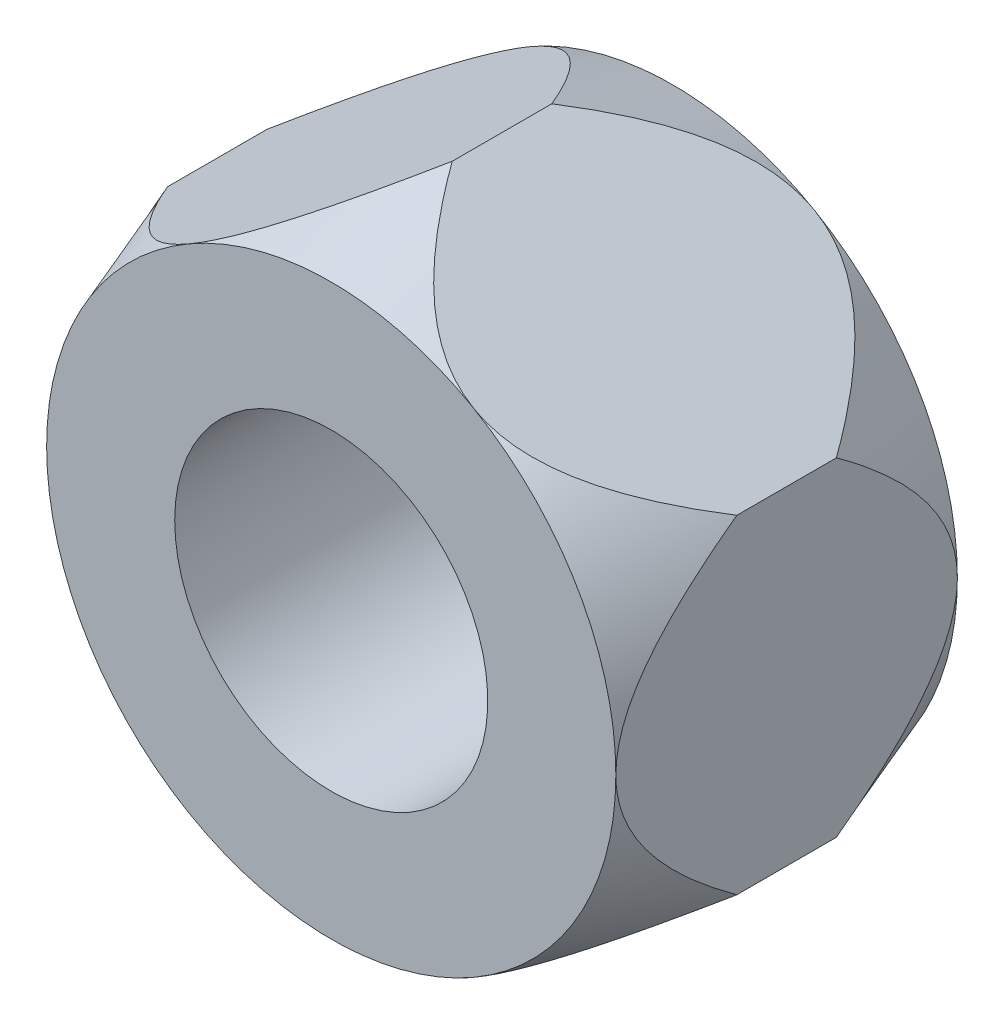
ISO-10303-21;
HEADER;
FILE_DESCRIPTION(('STEP AP214'),'2;1');
FILE_NAME('part.step','',(''),(''),'','','');
FILE_SCHEMA(('AUTOMOTIVE_DESIGN { 1 0 10303 214 1 1 1 1 }'));
ENDSEC;
DATA;
#1=APPLICATION_CONTEXT('core data for automotive mechanical design processes');
#2=APPLICATION_PROTOCOL_DEFINITION('international standard','automotive_design',2000,#1);
#3=PRODUCT_CONTEXT('',#1,'mechanical');
#4=PRODUCT('Part','Part','',(#3));
#5=PRODUCT_RELATED_PRODUCT_CATEGORY('part','',(#4));
#6=PRODUCT_DEFINITION_FORMATION('','',#4);
#7=PRODUCT_DEFINITION_CONTEXT('part definition',#1,'design');
#8=PRODUCT_DEFINITION('design','',#6,#7);
#9=PRODUCT_DEFINITION_SHAPE('','',#8);
#10=(LENGTH_UNIT() NAMED_UNIT(*) SI_UNIT(.MILLI.,.METRE.));
#11=(NAMED_UNIT(*) PLANE_ANGLE_UNIT() SI_UNIT($,.RADIAN.));
#12=(NAMED_UNIT(*) SI_UNIT($,.STERADIAN.) SOLID_ANGLE_UNIT());
#13=UNCERTAINTY_MEASURE_WITH_UNIT(LENGTH_MEASURE(1.E-05),#10,'distance_accuracy_value','');
#14=(GEOMETRIC_REPRESENTATION_CONTEXT(3) GLOBAL_UNCERTAINTY_ASSIGNED_CONTEXT((#13)) GLOBAL_UNIT_ASSIGNED_CONTEXT((#10,
#11,#12)) REPRESENTATION_CONTEXT('',''));
#15=CARTESIAN_POINT('',(0.,0.,0.));
#16=DIRECTION('',(0.,0.,1.));
#17=DIRECTION('',(1.,0.,0.));
#18=AXIS2_PLACEMENT_3D('',#15,#16,#17);
#19=CARTESIAN_POINT('',(5.00000000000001,2.88675134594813,6.));
#20=DIRECTION('',(-0.5,-0.866025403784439,0.));
#21=DIRECTION('',(0.866025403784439,-0.5,0.));
#22=AXIS2_PLACEMENT_3D('',#19,#20,#21);
#23=PLANE('',#22);
#24=CARTESIAN_POINT('',(-0.000199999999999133,5.7736181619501,2.12549844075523));
#25=CARTESIAN_POINT('',(0.044879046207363,5.74759176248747,2.05399586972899));
#26=CARTESIAN_POINT('',(0.0905472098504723,5.72122523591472,1.98299032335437));
#27=CARTESIAN_POINT('',(0.183229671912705,5.66771499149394,1.84213123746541));
#28=CARTESIAN_POINT('',(0.230244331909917,5.64057106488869,1.7722780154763));
#29=CARTESIAN_POINT('',(0.374195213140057,5.55746098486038,1.56376798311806));
#30=CARTESIAN_POINT('',(0.473408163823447,5.50018036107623,1.42717266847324));
#31=CARTESIAN_POINT('',(0.683416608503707,5.37893192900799,1.15667511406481));
#32=CARTESIAN_POINT('',(0.794511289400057,5.31479138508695,1.02308009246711));
#33=CARTESIAN_POINT('',(1.02703794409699,5.18054205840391,0.768915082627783));
#34=CARTESIAN_POINT('',(1.14843509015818,5.11045338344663,0.648304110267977));
#35=CARTESIAN_POINT('',(1.3237203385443,5.00925239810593,0.497123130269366));
#36=CARTESIAN_POINT('',(1.37190575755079,4.98143253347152,0.457734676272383));
#37=CARTESIAN_POINT('',(1.47021651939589,4.92467278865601,0.382319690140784));
#38=CARTESIAN_POINT('',(1.52034228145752,4.89573266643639,0.346293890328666));
#39=CARTESIAN_POINT('',(1.67314153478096,4.80751397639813,0.244666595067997));
#40=CARTESIAN_POINT('',(1.77889727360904,4.74645587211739,0.184925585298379));
#41=CARTESIAN_POINT('',(1.97713874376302,4.63200110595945,0.0969868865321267));
#42=CARTESIAN_POINT('',(2.06832790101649,4.57935302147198,0.0649525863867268));
#43=CARTESIAN_POINT('',(2.25412565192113,4.47208263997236,0.0190046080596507));
#44=CARTESIAN_POINT('',(2.34873161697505,4.41746186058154,0.00507729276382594));
#45=CARTESIAN_POINT('',(2.53893961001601,4.30764522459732,-0.00276626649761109));
#46=CARTESIAN_POINT('',(2.63454402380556,4.2524479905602,0.00339141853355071));
#47=CARTESIAN_POINT('',(2.82324643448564,4.14350060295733,0.0349681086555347));
#48=CARTESIAN_POINT('',(2.91634386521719,4.08975077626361,0.0603914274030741));
#49=CARTESIAN_POINT('',(3.1265001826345,3.96841696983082,0.137940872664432));
#50=CARTESIAN_POINT('',(3.24191214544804,3.90178384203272,0.195942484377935));
#51=CARTESIAN_POINT('',(3.40841134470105,3.80565548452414,0.29795984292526));
#52=CARTESIAN_POINT('',(3.46307182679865,3.77409724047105,0.334696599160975));
#53=CARTESIAN_POINT('',(3.57012380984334,3.71229074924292,0.412331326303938));
#54=CARTESIAN_POINT('',(3.62251592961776,3.68204214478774,0.453228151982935));
#55=CARTESIAN_POINT('',(3.80863269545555,3.57458757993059,0.607675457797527));
#56=CARTESIAN_POINT('',(3.93610886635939,3.50098917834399,0.731250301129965));
#57=CARTESIAN_POINT('',(4.17976162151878,3.36031619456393,0.992935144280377));
#58=CARTESIAN_POINT('',(4.29589288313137,3.29326777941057,1.13109919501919));
#59=CARTESIAN_POINT('',(4.51370525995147,3.16751374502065,1.40969560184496));
#60=CARTESIAN_POINT('',(4.6158157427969,3.10856023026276,1.54968434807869));
#61=CARTESIAN_POINT('',(4.76377257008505,3.0231373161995,1.76344181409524));
#62=CARTESIAN_POINT('',(4.81203428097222,2.99527340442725,1.83501952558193));
#63=CARTESIAN_POINT('',(4.90713666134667,2.94036601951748,1.97939050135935));
#64=CARTESIAN_POINT('',(4.95397774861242,2.91332230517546,2.05218339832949));
#65=CARTESIAN_POINT('',(5.00020000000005,2.88663587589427,2.12549844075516));
#66=B_SPLINE_CURVE_WITH_KNOTS('',3,(#24,#25,#26,#27,#28,#29,#30,#31,#32,#33,#34,#35,#36,#37,#38,
#39,#40,#41,#42,#43,#44,#45,#46,#47,#48,#49,#50,#51,#52,#53,#54,#55,#56,#57,#58,#59,#60,#61,#62,
#63,#64,#65),.UNSPECIFIED.,.F.,.F.,(4,2,2,2,2,2,2,2,2,2,2,2,2,2,2,2,2,2,2,2,4),(0.,
0.265318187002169,0.5307083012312,1.06522413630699,1.62036194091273,2.17369263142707,
2.3780959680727,2.58254371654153,2.98856700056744,3.31744445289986,3.64607407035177,
3.97591467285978,4.30582914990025,4.73925818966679,4.95823818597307,5.1771580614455,
5.75198484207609,6.32902141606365,6.87775652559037,7.14988137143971,7.42192539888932),.UNSPECIFIED.);
#67=CARTESIAN_POINT('',(0.,5.77350269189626,2.12518117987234));
#68=VERTEX_POINT('',#67);
#69=CARTESIAN_POINT('',(2.5,4.3301270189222,0.));
#70=VERTEX_POINT('',#69);
#71=EDGE_CURVE('E48',#68,#70,#66,.T.);
#72=ORIENTED_EDGE('',*,*,#71,.F.);
#73=DIRECTION('',(0.,0.,-1.));
#74=VECTOR('',#73,1.);
#75=CARTESIAN_POINT('',(0.,5.77350269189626,6.));
#76=LINE('',#75,#74);
#77=CARTESIAN_POINT('',(0.,5.77350269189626,3.87481882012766));
#78=VERTEX_POINT('',#77);
#79=EDGE_CURVE('E165',#78,#68,#76,.T.);
#80=ORIENTED_EDGE('',*,*,#79,.F.);
#81=CARTESIAN_POINT('',(5.0002,2.88663587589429,3.87450155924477));
#82=CARTESIAN_POINT('',(4.95512095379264,2.91266227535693,3.94600413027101));
#83=CARTESIAN_POINT('',(4.90945279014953,2.93902880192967,4.01700967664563));
#84=CARTESIAN_POINT('',(4.8167703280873,2.99253904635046,4.15786876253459));
#85=CARTESIAN_POINT('',(4.76975566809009,3.01968297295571,4.2277219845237));
#86=CARTESIAN_POINT('',(4.62580478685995,3.10279305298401,4.43623201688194));
#87=CARTESIAN_POINT('',(4.52659183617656,3.16007367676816,4.57282733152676));
#88=CARTESIAN_POINT('',(4.3165833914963,3.28132210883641,4.84332488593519));
#89=CARTESIAN_POINT('',(4.20548871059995,3.34546265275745,4.97691990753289));
#90=CARTESIAN_POINT('',(3.97296205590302,3.47971197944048,5.23108491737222));
#91=CARTESIAN_POINT('',(3.85156490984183,3.54980065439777,5.35169588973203));
#92=CARTESIAN_POINT('',(3.67627966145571,3.65100163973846,5.50287686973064));
#93=CARTESIAN_POINT('',(3.62809424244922,3.67882150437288,5.54226532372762));
#94=CARTESIAN_POINT('',(3.52978348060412,3.73558124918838,5.61768030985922));
#95=CARTESIAN_POINT('',(3.47965771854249,3.764521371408,5.65370610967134));
#96=CARTESIAN_POINT('',(3.32685846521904,3.85274006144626,5.75533340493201));
#97=CARTESIAN_POINT('',(3.22110272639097,3.913798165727,5.81507441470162));
#98=CARTESIAN_POINT('',(3.02286125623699,4.02825293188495,5.90301311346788));
#99=CARTESIAN_POINT('',(2.93167209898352,4.08090101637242,5.93504741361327));
#100=CARTESIAN_POINT('',(2.74587434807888,4.18817139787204,5.98099539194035));
#101=CARTESIAN_POINT('',(2.65126838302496,4.24279217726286,5.99492270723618));
#102=CARTESIAN_POINT('',(2.461060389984,4.35260881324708,6.00276626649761));
#103=CARTESIAN_POINT('',(2.36545597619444,4.40780604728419,5.99660858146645));
#104=CARTESIAN_POINT('',(2.17675356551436,4.51675343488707,5.96503189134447));
#105=CARTESIAN_POINT('',(2.08365613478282,4.57050326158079,5.93960857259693));
#106=CARTESIAN_POINT('',(1.87349981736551,4.69183706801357,5.86205912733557));
#107=CARTESIAN_POINT('',(1.75808785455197,4.75847019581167,5.80405751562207));
#108=CARTESIAN_POINT('',(1.59158865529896,4.85459855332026,5.70204015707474));
#109=CARTESIAN_POINT('',(1.53692817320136,4.88615679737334,5.66530340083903));
#110=CARTESIAN_POINT('',(1.42987619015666,4.94796328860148,5.58766867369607));
#111=CARTESIAN_POINT('',(1.37748407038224,4.97821189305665,5.54677184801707));
#112=CARTESIAN_POINT('',(1.19136730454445,5.0856664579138,5.39232454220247));
#113=CARTESIAN_POINT('',(1.06389113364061,5.1592648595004,5.26874969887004));
#114=CARTESIAN_POINT('',(0.820238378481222,5.29993784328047,5.00706485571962));
#115=CARTESIAN_POINT('',(0.704107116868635,5.36698625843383,4.86890080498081));
#116=CARTESIAN_POINT('',(0.486294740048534,5.49274029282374,4.59030439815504));
#117=CARTESIAN_POINT('',(0.384184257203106,5.55169380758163,4.45031565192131));
#118=CARTESIAN_POINT('',(0.236227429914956,5.63711672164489,4.23655818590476));
#119=CARTESIAN_POINT('',(0.18796571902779,5.66498063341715,4.16498047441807));
#120=CARTESIAN_POINT('',(0.0928633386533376,5.71988801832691,4.02060949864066));
#121=CARTESIAN_POINT('',(0.0460222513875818,5.74693173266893,3.94781660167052));
#122=CARTESIAN_POINT('',(-0.000200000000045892,5.77361816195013,3.87450155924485));
#123=B_SPLINE_CURVE_WITH_KNOTS('',3,(#81,#82,#83,#84,#85,#86,#87,#88,#89,#90,#91,#92,#93,#94,
#95,#96,#97,#98,#99,#100,#101,#102,#103,#104,#105,#106,#107,#108,#109,#110,#111,#112,#113,#114,
#115,#116,#117,#118,#119,#120,#121,#122),.UNSPECIFIED.,.F.,.F.,(4,2,2,2,2,2,2,2,2,2,2,2,2,2,2,2,
2,2,2,2,4),(0.,0.265318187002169,0.5307083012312,1.06522413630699,1.62036194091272,
2.17369263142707,2.3780959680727,2.58254371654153,2.98856700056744,3.31744445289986,
3.64607407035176,3.97591467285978,4.30582914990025,4.73925818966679,4.95823818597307,
5.1771580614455,5.7519848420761,6.32902141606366,6.87775652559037,7.14988137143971,
7.42192539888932),.UNSPECIFIED.);
#124=CARTESIAN_POINT('',(2.5,4.3301270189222,6.));
#125=VERTEX_POINT('',#124);
#126=EDGE_CURVE('E235',#125,#78,#123,.T.);
#127=ORIENTED_EDGE('',*,*,#126,.F.);
#128=CARTESIAN_POINT('',(5.00000000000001,2.88675134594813,3.87481882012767));
#129=VERTEX_POINT('',#128);
#130=EDGE_CURVE('E156',#129,#125,#123,.T.);
#131=ORIENTED_EDGE('',*,*,#130,.F.);
#132=DIRECTION('',(0.,0.,-1.));
#133=VECTOR('',#132,1.);
#134=CARTESIAN_POINT('',(5.00000000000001,2.88675134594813,6.));
#135=LINE('',#134,#133);
#136=CARTESIAN_POINT('',(5.00000000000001,2.88675134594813,2.12518117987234));
#137=VERTEX_POINT('',#136);
#138=EDGE_CURVE('E151',#129,#137,#135,.T.);
#139=ORIENTED_EDGE('',*,*,#138,.T.);
#140=EDGE_CURVE('E143',#70,#137,#66,.T.);
#141=ORIENTED_EDGE('',*,*,#140,.F.);
#142=EDGE_LOOP('',(#72,#80,#127,#131,#139,#141));
#143=FACE_BOUND('',#142,.T.);
#144=ADVANCED_FACE('F32',(#143),#23,.F.);
#145=CARTESIAN_POINT('',(0.,5.77350269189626,6.));
#146=DIRECTION('',(0.5,-0.866025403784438,0.));
#147=DIRECTION('',(0.866025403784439,0.5,0.));
#148=AXIS2_PLACEMENT_3D('',#145,#146,#147);
#149=PLANE('',#148);
#150=CARTESIAN_POINT('',(-5.0002,2.88663587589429,2.12549844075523));
#151=CARTESIAN_POINT('',(-4.95512095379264,2.91266227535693,2.05399586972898));
#152=CARTESIAN_POINT('',(-4.90945279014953,2.93902880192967,1.98299032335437));
#153=CARTESIAN_POINT('',(-4.8167703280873,2.99253904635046,1.84213123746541));
#154=CARTESIAN_POINT('',(-4.76975566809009,3.01968297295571,1.7722780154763));
#155=CARTESIAN_POINT('',(-4.62580478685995,3.10279305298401,1.56376798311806));
#156=CARTESIAN_POINT('',(-4.52659183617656,3.16007367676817,1.42717266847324));
#157=CARTESIAN_POINT('',(-4.3165833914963,3.28132210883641,1.15667511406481));
#158=CARTESIAN_POINT('',(-4.20548871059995,3.34546265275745,1.02308009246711));
#159=CARTESIAN_POINT('',(-3.97296205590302,3.47971197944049,0.768915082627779));
#160=CARTESIAN_POINT('',(-3.85156490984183,3.54980065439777,0.648304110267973));
#161=CARTESIAN_POINT('',(-3.67627966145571,3.65100163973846,0.497123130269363));
#162=CARTESIAN_POINT('',(-3.62809424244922,3.67882150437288,0.45773467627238));
#163=CARTESIAN_POINT('',(-3.52978348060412,3.73558124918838,0.38231969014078));
#164=CARTESIAN_POINT('',(-3.47965771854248,3.764521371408,0.346293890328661));
#165=CARTESIAN_POINT('',(-3.32685846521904,3.85274006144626,0.244666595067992));
#166=CARTESIAN_POINT('',(-3.22110272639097,3.913798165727,0.184925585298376));
#167=CARTESIAN_POINT('',(-3.02286125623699,4.02825293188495,0.096986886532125));
#168=CARTESIAN_POINT('',(-2.93167209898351,4.08090101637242,0.0649525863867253));
#169=CARTESIAN_POINT('',(-2.74587434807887,4.18817139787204,0.0190046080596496));
#170=CARTESIAN_POINT('',(-2.65126838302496,4.24279217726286,0.00507729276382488));
#171=CARTESIAN_POINT('',(-2.461060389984,4.35260881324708,-0.00276626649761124));
#172=CARTESIAN_POINT('',(-2.36545597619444,4.40780604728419,0.00339141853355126));
#173=CARTESIAN_POINT('',(-2.17675356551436,4.51675343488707,0.0349681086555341));
#174=CARTESIAN_POINT('',(-2.08365613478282,4.57050326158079,0.0603914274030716));
#175=CARTESIAN_POINT('',(-1.87349981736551,4.69183706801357,0.137940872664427));
#176=CARTESIAN_POINT('',(-1.75808785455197,4.75847019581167,0.19594248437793));
#177=CARTESIAN_POINT('',(-1.59158865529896,4.85459855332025,0.297959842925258));
#178=CARTESIAN_POINT('',(-1.53692817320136,4.88615679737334,0.334696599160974));
#179=CARTESIAN_POINT('',(-1.42987619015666,4.94796328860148,0.412331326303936));
#180=CARTESIAN_POINT('',(-1.37748407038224,4.97821189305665,0.453228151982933));
#181=CARTESIAN_POINT('',(-1.19136730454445,5.0856664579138,0.607675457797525));
#182=CARTESIAN_POINT('',(-1.06389113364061,5.1592648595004,0.731250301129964));
#183=CARTESIAN_POINT('',(-0.820238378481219,5.29993784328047,0.992935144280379));
#184=CARTESIAN_POINT('',(-0.704107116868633,5.36698625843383,1.13109919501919));
#185=CARTESIAN_POINT('',(-0.486294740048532,5.49274029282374,1.40969560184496));
#186=CARTESIAN_POINT('',(-0.384184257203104,5.55169380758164,1.5496843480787));
#187=CARTESIAN_POINT('',(-0.236227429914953,5.63711672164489,1.76344181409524));
#188=CARTESIAN_POINT('',(-0.187965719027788,5.66498063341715,1.83501952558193));
#189=CARTESIAN_POINT('',(-0.0928633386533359,5.71988801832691,1.97939050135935));
#190=CARTESIAN_POINT('',(-0.0460222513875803,5.74693173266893,2.05218339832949));
#191=CARTESIAN_POINT('',(0.000200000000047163,5.77361816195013,2.12549844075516));
#192=B_SPLINE_CURVE_WITH_KNOTS('',3,(#150,#151,#152,#153,#154,#155,#156,#157,#158,#159,#160,
#161,#162,#163,#164,#165,#166,#167,#168,#169,#170,#171,#172,#173,#174,#175,#176,#177,#178,#179,
#180,#181,#182,#183,#184,#185,#186,#187,#188,#189,#190,#191),.UNSPECIFIED.,.F.,.F.,(4,2,2,2,2,2,
2,2,2,2,2,2,2,2,2,2,2,2,2,2,4),(0.,0.265318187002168,0.530708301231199,1.06522413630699,
1.62036194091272,2.17369263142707,2.3780959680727,2.58254371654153,2.98856700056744,
3.31744445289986,3.64607407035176,3.97591467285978,4.30582914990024,4.73925818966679,
4.95823818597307,5.1771580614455,5.7519848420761,6.32902141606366,6.87775652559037,
7.14988137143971,7.42192539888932),.UNSPECIFIED.);
#193=CARTESIAN_POINT('',(-5.,2.88675134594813,2.12518117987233));
#194=VERTEX_POINT('',#193);
#195=CARTESIAN_POINT('',(-2.5,4.3301270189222,0.));
#196=VERTEX_POINT('',#195);
#197=EDGE_CURVE('E55',#194,#196,#192,.T.);
#198=ORIENTED_EDGE('',*,*,#197,.F.);
#199=DIRECTION('',(0.,0.,-1.));
#200=VECTOR('',#199,1.);
#201=CARTESIAN_POINT('',(-5.,2.88675134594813,6.));
#202=LINE('',#201,#200);
#203=CARTESIAN_POINT('',(-5.,2.88675134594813,3.87481882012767));
#204=VERTEX_POINT('',#203);
#205=EDGE_CURVE('E162',#204,#194,#202,.T.);
#206=ORIENTED_EDGE('',*,*,#205,.F.);
#207=CARTESIAN_POINT('',(0.000200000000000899,5.7736181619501,3.87450155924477));
#208=CARTESIAN_POINT('',(-0.044879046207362,5.74759176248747,3.94600413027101));
#209=CARTESIAN_POINT('',(-0.0905472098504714,5.72122523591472,4.01700967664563));
#210=CARTESIAN_POINT('',(-0.183229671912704,5.66771499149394,4.15786876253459));
#211=CARTESIAN_POINT('',(-0.230244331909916,5.64057106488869,4.2277219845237));
#212=CARTESIAN_POINT('',(-0.374195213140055,5.55746098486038,4.43623201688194));
#213=CARTESIAN_POINT('',(-0.473408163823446,5.50018036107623,4.57282733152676));
#214=CARTESIAN_POINT('',(-0.683416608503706,5.37893192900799,4.84332488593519));
#215=CARTESIAN_POINT('',(-0.794511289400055,5.31479138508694,4.97691990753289));
#216=CARTESIAN_POINT('',(-1.02703794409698,5.18054205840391,5.23108491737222));
#217=CARTESIAN_POINT('',(-1.14843509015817,5.11045338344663,5.35169588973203));
#218=CARTESIAN_POINT('',(-1.32372033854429,5.00925239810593,5.50287686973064));
#219=CARTESIAN_POINT('',(-1.37190575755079,4.98143253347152,5.54226532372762));
#220=CARTESIAN_POINT('',(-1.47021651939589,4.92467278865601,5.61768030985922));
#221=CARTESIAN_POINT('',(-1.52034228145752,4.89573266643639,5.65370610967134));
#222=CARTESIAN_POINT('',(-1.67314153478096,4.80751397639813,5.75533340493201));
#223=CARTESIAN_POINT('',(-1.77889727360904,4.74645587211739,5.81507441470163));
#224=CARTESIAN_POINT('',(-1.97713874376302,4.63200110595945,5.90301311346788));
#225=CARTESIAN_POINT('',(-2.06832790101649,4.57935302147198,5.93504741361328));
#226=CARTESIAN_POINT('',(-2.25412565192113,4.47208263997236,5.98099539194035));
#227=CARTESIAN_POINT('',(-2.34873161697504,4.41746186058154,5.99492270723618));
#228=CARTESIAN_POINT('',(-2.53893961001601,4.30764522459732,6.00276626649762));
#229=CARTESIAN_POINT('',(-2.63454402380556,4.2524479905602,5.99660858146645));
#230=CARTESIAN_POINT('',(-2.82324643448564,4.14350060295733,5.96503189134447));
#231=CARTESIAN_POINT('',(-2.91634386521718,4.08975077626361,5.93960857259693));
#232=CARTESIAN_POINT('',(-3.12650018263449,3.96841696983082,5.86205912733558));
#233=CARTESIAN_POINT('',(-3.24191214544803,3.90178384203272,5.80405751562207));
#234=CARTESIAN_POINT('',(-3.40841134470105,3.80565548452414,5.70204015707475));
#235=CARTESIAN_POINT('',(-3.46307182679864,3.77409724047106,5.66530340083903));
#236=CARTESIAN_POINT('',(-3.57012380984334,3.71229074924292,5.58766867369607));
#237=CARTESIAN_POINT('',(-3.62251592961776,3.68204214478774,5.54677184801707));
#238=CARTESIAN_POINT('',(-3.80863269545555,3.57458757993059,5.39232454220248));
#239=CARTESIAN_POINT('',(-3.93610886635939,3.50098917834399,5.26874969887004));
#240=CARTESIAN_POINT('',(-4.17976162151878,3.36031619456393,5.00706485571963));
#241=CARTESIAN_POINT('',(-4.29589288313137,3.29326777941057,4.86890080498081));
#242=CARTESIAN_POINT('',(-4.51370525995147,3.16751374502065,4.59030439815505));
#243=CARTESIAN_POINT('',(-4.6158157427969,3.10856023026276,4.45031565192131));
#244=CARTESIAN_POINT('',(-4.76377257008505,3.0231373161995,4.23655818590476));
#245=CARTESIAN_POINT('',(-4.81203428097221,2.99527340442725,4.16498047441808));
#246=CARTESIAN_POINT('',(-4.90713666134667,2.94036601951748,4.02060949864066));
#247=CARTESIAN_POINT('',(-4.95397774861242,2.91332230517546,3.94781660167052));
#248=CARTESIAN_POINT('',(-5.00020000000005,2.88663587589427,3.87450155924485));
#249=B_SPLINE_CURVE_WITH_KNOTS('',3,(#207,#208,#209,#210,#211,#212,#213,#214,#215,#216,#217,
#218,#219,#220,#221,#222,#223,#224,#225,#226,#227,#228,#229,#230,#231,#232,#233,#234,#235,#236,
#237,#238,#239,#240,#241,#242,#243,#244,#245,#246,#247,#248),.UNSPECIFIED.,.F.,.F.,(4,2,2,2,2,2,
2,2,2,2,2,2,2,2,2,2,2,2,2,2,4),(0.,0.265318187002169,0.5307083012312,1.06522413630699,
1.62036194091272,2.17369263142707,2.3780959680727,2.58254371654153,2.98856700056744,
3.31744445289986,3.64607407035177,3.97591467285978,4.30582914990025,4.73925818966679,
4.95823818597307,5.1771580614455,5.7519848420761,6.32902141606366,6.87775652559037,
7.14988137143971,7.42192539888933),.UNSPECIFIED.);
#250=CARTESIAN_POINT('',(-2.5,4.3301270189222,6.));
#251=VERTEX_POINT('',#250);
#252=EDGE_CURVE('E289',#251,#204,#249,.T.);
#253=ORIENTED_EDGE('',*,*,#252,.F.);
#254=EDGE_CURVE('E293',#78,#251,#249,.T.);
#255=ORIENTED_EDGE('',*,*,#254,.F.);
#256=ORIENTED_EDGE('',*,*,#79,.T.);
#257=EDGE_CURVE('E273',#196,#68,#192,.T.);
#258=ORIENTED_EDGE('',*,*,#257,.F.);
#259=EDGE_LOOP('',(#198,#206,#253,#255,#256,#258));
#260=FACE_BOUND('',#259,.T.);
#261=ADVANCED_FACE('F282',(#260),#149,.F.);
#262=CARTESIAN_POINT('',(-5.,2.88675134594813,6.));
#263=DIRECTION('',(1.,0.,0.));
#264=DIRECTION('',(0.,0.,-1.));
#265=AXIS2_PLACEMENT_3D('',#262,#263,#264);
#266=PLANE('',#265);
#267=CARTESIAN_POINT('',(-5.,-10.593425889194,18.4469006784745));
#268=CARTESIAN_POINT('',(-5.,-10.4665806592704,18.1317420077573));
#269=CARTESIAN_POINT('',(-5.,-10.3393814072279,17.8167258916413));
#270=CARTESIAN_POINT('',(-5.,-10.0841870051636,17.187015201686));
#271=CARTESIAN_POINT('',(-5.,-9.95619185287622,16.872320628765));
#272=CARTESIAN_POINT('',(-5.,-9.57080930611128,15.9285989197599));
#273=CARTESIAN_POINT('',(-5.,-9.31209636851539,15.3001118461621));
#274=CARTESIAN_POINT('',(-5.,-8.78765492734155,14.0388678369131));
#275=CARTESIAN_POINT('',(-5.,-8.52188259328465,13.4061291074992));
#276=CARTESIAN_POINT('',(-5.,-7.98449567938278,12.1433127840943));
#277=CARTESIAN_POINT('',(-5.,-7.71288255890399,11.5132345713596));
#278=CARTESIAN_POINT('',(-5.,-7.2811153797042,10.5287804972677));
#279=CARTESIAN_POINT('',(-5.,-7.12365411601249,10.1732239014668));
#280=CARTESIAN_POINT('',(-5.,-6.80565772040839,9.46348745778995));
#281=CARTESIAN_POINT('',(-5.,-6.64512260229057,9.10930760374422));
#282=CARTESIAN_POINT('',(-5.,-6.32017815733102,8.4023707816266));
#283=CARTESIAN_POINT('',(-5.,-6.15576572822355,8.0496152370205));
#284=CARTESIAN_POINT('',(-5.,-5.82230655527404,7.34631497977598));
#285=CARTESIAN_POINT('',(-5.,-5.65326002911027,6.99577016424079));
#286=CARTESIAN_POINT('',(-5.,-5.31016326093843,6.29934055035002));
#287=CARTESIAN_POINT('',(-5.,-5.13614277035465,5.95344113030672));
#288=CARTESIAN_POINT('',(-5.,-4.7805782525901,5.26553015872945));
#289=CARTESIAN_POINT('',(-5.,-4.59903475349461,4.923518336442));
#290=CARTESIAN_POINT('',(-5.,-4.31923745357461,4.41488929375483));
#291=CARTESIAN_POINT('',(-5.,-4.22478528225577,4.24618051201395));
#292=CARTESIAN_POINT('',(-5.,-4.03289242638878,3.91047406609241));
#293=CARTESIAN_POINT('',(-5.,-3.93545185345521,3.74347633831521));
#294=CARTESIAN_POINT('',(-5.,-3.73705225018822,3.41166365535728));
#295=CARTESIAN_POINT('',(-5.,-3.63609453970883,3.24684791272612));
#296=CARTESIAN_POINT('',(-5.,-3.4299007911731,2.91992234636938));
#297=CARTESIAN_POINT('',(-5.,-3.32466522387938,2.75781222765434));
#298=CARTESIAN_POINT('',(-5.,-3.16828099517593,2.52534627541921));
#299=CARTESIAN_POINT('',(-5.,-3.11922859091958,2.45357834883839));
#300=CARTESIAN_POINT('',(-5.,-3.01994203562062,2.31085890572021));
#301=CARTESIAN_POINT('',(-5.,-2.96970781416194,2.23990743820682));
#302=CARTESIAN_POINT('',(-5.,-2.81701601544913,2.02840027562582));
#303=CARTESIAN_POINT('',(-5.,-2.71260250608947,1.88924157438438));
#304=CARTESIAN_POINT('',(-5.,-2.49795724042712,1.61675362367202));
#305=CARTESIAN_POINT('',(-5.,-2.38776259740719,1.48339533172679));
#306=CARTESIAN_POINT('',(-5.,-2.15942685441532,1.22370865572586));
#307=CARTESIAN_POINT('',(-5.,-2.04129054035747,1.09737612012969));
#308=CARTESIAN_POINT('',(-5.,-1.80021819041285,0.860138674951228));
#309=CARTESIAN_POINT('',(-5.,-1.67771226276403,0.748802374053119));
#310=CARTESIAN_POINT('',(-5.,-1.42104823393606,0.540073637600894));
#311=CARTESIAN_POINT('',(-5.,-1.28689321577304,0.442677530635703));
#312=CARTESIAN_POINT('',(-5.,-1.0354903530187,0.288393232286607));
#313=CARTESIAN_POINT('',(-5.,-0.920873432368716,0.227300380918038));
#314=CARTESIAN_POINT('',(-5.,-0.683400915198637,0.124012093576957));
#315=CARTESIAN_POINT('',(-5.,-0.560565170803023,0.0817728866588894));
#316=CARTESIAN_POINT('',(-5.,-0.332519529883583,0.0275029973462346));
#317=CARTESIAN_POINT('',(-5.,-0.22832203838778,0.0112937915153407));
#318=CARTESIAN_POINT('',(-5.,-0.0186789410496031,-0.0029139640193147));
#319=CARTESIAN_POINT('',(-5.,0.0867661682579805,-0.000919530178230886));
#320=CARTESIAN_POINT('',(-5.,0.295478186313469,0.0209840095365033));
#321=CARTESIAN_POINT('',(-5.,0.398749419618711,0.0408532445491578));
#322=CARTESIAN_POINT('',(-5.,0.60097054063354,0.0961023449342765));
#323=CARTESIAN_POINT('',(-5.,0.699917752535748,0.131491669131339));
#324=CARTESIAN_POINT('',(-5.,0.952810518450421,0.240731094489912));
#325=CARTESIAN_POINT('',(-5.,1.10232252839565,0.3247819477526));
#326=CARTESIAN_POINT('',(-5.,1.31590864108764,0.46651633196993));
#327=CARTESIAN_POINT('',(-5.,1.38547728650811,0.516509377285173));
#328=CARTESIAN_POINT('',(-5.,1.52137474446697,0.620734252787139));
#329=CARTESIAN_POINT('',(-5.,1.58770432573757,0.674965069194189));
#330=CARTESIAN_POINT('',(-5.,1.74555384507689,0.811056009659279));
#331=CARTESIAN_POINT('',(-5.,1.83552445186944,0.894699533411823));
#332=CARTESIAN_POINT('',(-5.,2.010392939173,1.06716405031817));
#333=CARTESIAN_POINT('',(-5.,2.09528822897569,1.15598764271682));
#334=CARTESIAN_POINT('',(-5.,2.26091068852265,1.3377149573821));
#335=CARTESIAN_POINT('',(-5.,2.3416299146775,1.4306258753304));
#336=CARTESIAN_POINT('',(-5.,2.49940634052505,1.61951078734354));
#337=CARTESIAN_POINT('',(-5.,2.57646307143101,1.71548517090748));
#338=CARTESIAN_POINT('',(-5.,2.72837198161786,1.91104841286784));
#339=CARTESIAN_POINT('',(-5.,2.80318552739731,2.01066716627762));
#340=CARTESIAN_POINT('',(-5.,2.95006434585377,2.2119097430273));
#341=CARTESIAN_POINT('',(-5.,3.02212951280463,2.31353364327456));
#342=CARTESIAN_POINT('',(-5.,3.16379157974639,2.51829064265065));
#343=CARTESIAN_POINT('',(-5.,3.23339153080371,2.62142163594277));
#344=CARTESIAN_POINT('',(-5.,3.37051843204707,2.82904290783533));
#345=CARTESIAN_POINT('',(-5.,3.43804546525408,2.93353313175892));
#346=CARTESIAN_POINT('',(-5.,3.66316671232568,3.28852254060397));
#347=CARTESIAN_POINT('',(-5.,3.81656524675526,3.54168566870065));
#348=CARTESIAN_POINT('',(-5.,4.11572228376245,4.05250222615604));
#349=CARTESIAN_POINT('',(-5.,4.26147936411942,4.31015647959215));
#350=CARTESIAN_POINT('',(-5.,4.54711316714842,4.82888390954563));
#351=CARTESIAN_POINT('',(-5.,4.68698652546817,5.08995893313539));
#352=CARTESIAN_POINT('',(-5.,4.96198814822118,5.61459826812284));
#353=CARTESIAN_POINT('',(-5.,5.09711624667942,5.87816266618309));
#354=CARTESIAN_POINT('',(-5.,5.36392060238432,6.40803501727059));
#355=CARTESIAN_POINT('',(-5.,5.49558509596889,6.67434888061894));
#356=CARTESIAN_POINT('',(-5.,5.75570617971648,7.20854011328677));
#357=CARTESIAN_POINT('',(-5.,5.88416272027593,7.4764175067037));
#358=CARTESIAN_POINT('',(-5.,6.26543969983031,8.28175203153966));
#359=CARTESIAN_POINT('',(-5.,6.51426230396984,8.82110188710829));
#360=CARTESIAN_POINT('',(-5.,6.97583475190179,9.8406759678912));
#361=CARTESIAN_POINT('',(-5.,7.18942739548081,10.3205211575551));
#362=CARTESIAN_POINT('',(-5.,7.61190695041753,11.2823346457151));
#363=CARTESIAN_POINT('',(-5.,7.82079338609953,11.7643031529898));
#364=CARTESIAN_POINT('',(-5.,8.23360917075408,12.727033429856));
#365=CARTESIAN_POINT('',(-5.,8.4375603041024,13.2077858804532));
#366=CARTESIAN_POINT('',(-5.,8.84238732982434,14.1705076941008));
#367=CARTESIAN_POINT('',(-5.,9.04326363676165,14.6524768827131));
#368=CARTESIAN_POINT('',(-5.,9.24294648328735,15.1349352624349));
#369=B_SPLINE_CURVE_WITH_KNOTS('',3,(#267,#268,#269,#270,#271,#272,#273,#274,#275,#276,#277,
#278,#279,#280,#281,#282,#283,#284,#285,#286,#287,#288,#289,#290,#291,#292,#293,#294,#295,#296,
#297,#298,#299,#300,#301,#302,#303,#304,#305,#306,#307,#308,#309,#310,#311,#312,#313,#314,#315,
#316,#317,#318,#319,#320,#321,#322,#323,#324,#325,#326,#327,#328,#329,#330,#331,#332,#333,#334,
#335,#336,#337,#338,#339,#340,#341,#342,#343,#344,#345,#346,#347,#348,#349,#350,#351,#352,#353,
#354,#355,#356,#357,#358,#359,#360,#361,#362,#363,#364,#365,#366,#367,#368),.UNSPECIFIED.,.F.,
.F.,(4,2,2,2,2,2,2,2,2,2,2,2,2,2,2,2,2,2,2,2,2,2,2,2,2,2,2,2,2,2,2,2,2,2,2,2,2,2,2,2,2,2,2,2,2,
2,2,2,2,2,4),(0.,1.01918170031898,2.038366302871,4.07731117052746,6.13615917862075,
8.19449861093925,9.36107677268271,10.5276497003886,11.6951899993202,12.8626755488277,
14.0242354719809,15.1857139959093,15.7657376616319,16.345739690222,16.9255263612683,
17.5052494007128,17.7660280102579,18.0268221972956,18.548589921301,19.0673421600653,
19.5857845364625,20.0817511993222,20.5775869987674,20.9660360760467,21.3535785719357,
21.66847310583,21.9832462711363,22.2973190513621,22.6115835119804,23.1229758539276,
23.3799048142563,23.6367724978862,24.005028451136,24.373470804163,24.7425900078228,
25.1117563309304,25.4854507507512,25.8591595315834,26.2323883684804,26.6056022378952,
27.4934242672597,28.38141095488,29.2698986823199,30.1584174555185,31.0496417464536,
31.9408798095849,33.7227180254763,35.2984010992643,36.8742427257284,38.4409069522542,
40.0073580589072),.UNSPECIFIED.);
#370=CARTESIAN_POINT('',(-5.,-2.88675134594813,2.12518117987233));
#371=VERTEX_POINT('',#370);
#372=CARTESIAN_POINT('',(-5.,0.,0.));
#373=VERTEX_POINT('',#372);
#374=EDGE_CURVE('E302',#371,#373,#369,.T.);
#375=ORIENTED_EDGE('',*,*,#374,.F.);
#376=DIRECTION('',(0.,0.,-1.));
#377=VECTOR('',#376,1.);
#378=CARTESIAN_POINT('',(-5.,-2.88675134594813,6.));
#379=LINE('',#378,#377);
#380=CARTESIAN_POINT('',(-5.,-2.88675134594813,3.87481882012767));
#381=VERTEX_POINT('',#380);
#382=EDGE_CURVE('E153',#381,#371,#379,.T.);
#383=ORIENTED_EDGE('',*,*,#382,.F.);
#384=CARTESIAN_POINT('',(-5.,-6.46710273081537,-2.72202965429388));
#385=CARTESIAN_POINT('',(-5.,-6.34100200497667,-2.44799278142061));
#386=CARTESIAN_POINT('',(-5.,-6.21380093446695,-2.17445591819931));
#387=CARTESIAN_POINT('',(-5.,-5.95667824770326,-1.62860333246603));
#388=CARTESIAN_POINT('',(-5.,-5.82675613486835,-1.35628784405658));
#389=CARTESIAN_POINT('',(-5.,-5.5626153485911,-0.810924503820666));
#390=CARTESIAN_POINT('',(-5.,-5.42836979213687,-0.53788964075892));
#391=CARTESIAN_POINT('',(-5.,-5.15594440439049,0.00617473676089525));
#392=CARTESIAN_POINT('',(-5.,-5.01776503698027,0.277204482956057));
#393=CARTESIAN_POINT('',(-5.,-4.7120505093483,0.863712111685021));
#394=CARTESIAN_POINT('',(-5.,-4.54359359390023,1.17871126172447));
#395=CARTESIAN_POINT('',(-5.,-4.19780053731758,1.80402158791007));
#396=CARTESIAN_POINT('',(-5.,-4.0204607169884,2.11433075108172));
#397=CARTESIAN_POINT('',(-5.,-3.74577778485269,2.57375323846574));
#398=CARTESIAN_POINT('',(-5.,-3.65297244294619,2.72557887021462));
#399=CARTESIAN_POINT('',(-5.,-3.46378292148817,3.02697859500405));
#400=CARTESIAN_POINT('',(-5.,-3.36739899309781,3.17655284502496));
#401=CARTESIAN_POINT('',(-5.,-3.17039408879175,3.47273693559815));
#402=CARTESIAN_POINT('',(-5.,-3.06977624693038,3.61934885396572));
#403=CARTESIAN_POINT('',(-5.,-2.86330028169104,3.90881964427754));
#404=CARTESIAN_POINT('',(-5.,-2.75744332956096,4.05167934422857));
#405=CARTESIAN_POINT('',(-5.,-2.59295691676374,4.26319949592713));
#406=CARTESIAN_POINT('',(-5.,-2.53675051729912,4.33374417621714));
#407=CARTESIAN_POINT('',(-5.,-2.42243909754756,4.47327875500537));
#408=CARTESIAN_POINT('',(-5.,-2.36433400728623,4.54226859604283));
#409=CARTESIAN_POINT('',(-5.,-2.18664230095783,4.74668893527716));
#410=CARTESIAN_POINT('',(-5.,-2.06382894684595,4.87937462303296));
#411=CARTESIAN_POINT('',(-5.,-1.81003884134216,5.13110969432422));
#412=CARTESIAN_POINT('',(-5.,-1.67929571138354,5.25039171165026));
#413=CARTESIAN_POINT('',(-5.,-1.40478807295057,5.47264200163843));
#414=CARTESIAN_POINT('',(-5.,-1.26106521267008,5.57565972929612));
#415=CARTESIAN_POINT('',(-5.,-1.0051409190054,5.72795338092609));
#416=CARTESIAN_POINT('',(-5.,-0.897026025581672,5.78398104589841));
#417=CARTESIAN_POINT('',(-5.,-0.673554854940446,5.87921982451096));
#418=CARTESIAN_POINT('',(-5.,-0.558207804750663,5.91845188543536));
#419=CARTESIAN_POINT('',(-5.,-0.320634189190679,5.9756497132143));
#420=CARTESIAN_POINT('',(-5.,-0.198340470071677,5.99334804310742));
#421=CARTESIAN_POINT('',(-5.,0.0473970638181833,6.00352221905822));
#422=CARTESIAN_POINT('',(-5.,0.170841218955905,5.99599034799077));
#423=CARTESIAN_POINT('',(-5.,0.395536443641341,5.96001846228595));
#424=CARTESIAN_POINT('',(-5.,0.497348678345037,5.9348689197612));
#425=CARTESIAN_POINT('',(-5.,0.696156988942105,5.87014001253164));
#426=CARTESIAN_POINT('',(-5.,0.793153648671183,5.8305624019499));
#427=CARTESIAN_POINT('',(-5.,0.970520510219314,5.74541745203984));
#428=CARTESIAN_POINT('',(-5.,1.05150565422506,5.70109909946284));
#429=CARTESIAN_POINT('',(-5.,1.20929825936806,5.60550076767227));
#430=CARTESIAN_POINT('',(-5.,1.28610245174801,5.55421544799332));
#431=CARTESIAN_POINT('',(-5.,1.43606660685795,5.44600653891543));
#432=CARTESIAN_POINT('',(-5.,1.50921041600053,5.38906079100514));
#433=CARTESIAN_POINT('',(-5.,1.65189468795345,5.27089830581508));
#434=CARTESIAN_POINT('',(-5.,1.72143624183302,5.20968287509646));
#435=CARTESIAN_POINT('',(-5.,1.89324447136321,5.05063798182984));
#436=CARTESIAN_POINT('',(-5.,1.99340620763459,4.95053994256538));
#437=CARTESIAN_POINT('',(-5.,2.18769832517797,4.7446162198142));
#438=CARTESIAN_POINT('',(-5.,2.28182508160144,4.6387871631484));
#439=CARTESIAN_POINT('',(-5.,2.46523969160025,4.42268723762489));
#440=CARTESIAN_POINT('',(-5.,2.55451784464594,4.31240818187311));
#441=CARTESIAN_POINT('',(-5.,2.72889847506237,4.08859219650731));
#442=CARTESIAN_POINT('',(-5.,2.81400040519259,3.97505484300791));
#443=CARTESIAN_POINT('',(-5.,2.98163840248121,3.74412995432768));
#444=CARTESIAN_POINT('',(-5.,3.06413419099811,3.62671329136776));
#445=CARTESIAN_POINT('',(-5.,3.22608359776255,3.38979944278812));
#446=CARTESIAN_POINT('',(-5.,3.30553707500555,3.27030216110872));
#447=CARTESIAN_POINT('',(-5.,3.46173254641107,3.02978426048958));
#448=CARTESIAN_POINT('',(-5.,3.53847809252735,2.90876594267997));
#449=CARTESIAN_POINT('',(-5.,3.68971804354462,2.66534102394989));
#450=CARTESIAN_POINT('',(-5.,3.76421253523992,2.54293447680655));
#451=CARTESIAN_POINT('',(-5.,4.0093492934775,2.13288118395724));
#452=CARTESIAN_POINT('',(-5.,4.17567425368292,1.84265111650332));
#453=CARTESIAN_POINT('',(-5.,4.50047112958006,1.25781527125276));
#454=CARTESIAN_POINT('',(-5.,4.65894185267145,0.963208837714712));
#455=CARTESIAN_POINT('',(-5.,4.96987137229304,0.370676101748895));
#456=CARTESIAN_POINT('',(-5.,5.12232736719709,0.0727483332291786));
#457=CARTESIAN_POINT('',(-5.,5.42242500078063,-0.525523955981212));
#458=CARTESIAN_POINT('',(-5.,5.57006650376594,-0.825868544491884));
#459=CARTESIAN_POINT('',(-5.,5.86183421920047,-1.42922103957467));
#460=CARTESIAN_POINT('',(-5.,6.00595028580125,-1.73223384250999));
#461=CARTESIAN_POINT('',(-5.,6.29096002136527,-2.3397726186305));
#462=CARTESIAN_POINT('',(-5.,6.43185364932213,-2.64429861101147));
#463=CARTESIAN_POINT('',(-5.,6.85044916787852,-3.55952926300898));
#464=CARTESIAN_POINT('',(-5.,7.12415040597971,-4.17206356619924));
#465=CARTESIAN_POINT('',(-5.,7.63513271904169,-5.33507892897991));
#466=CARTESIAN_POINT('',(-5.,7.87318833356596,-5.88522170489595));
#467=CARTESIAN_POINT('',(-5.,8.34455990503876,-6.98758674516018));
#468=CARTESIAN_POINT('',(-5.,8.57787546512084,-7.53980917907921));
#469=CARTESIAN_POINT('',(-5.,9.03963083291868,-8.64313362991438));
#470=CARTESIAN_POINT('',(-5.,9.26808882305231,-9.19422805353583));
#471=CARTESIAN_POINT('',(-5.,9.72194287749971,-10.2976051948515));
#472=CARTESIAN_POINT('',(-5.,9.94733928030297,-10.8498877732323));
#473=CARTESIAN_POINT('',(-5.,10.1715567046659,-11.4026443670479));
#474=B_SPLINE_CURVE_WITH_KNOTS('',3,(#384,#385,#386,#387,#388,#389,#390,#391,#392,#393,#394,
#395,#396,#397,#398,#399,#400,#401,#402,#403,#404,#405,#406,#407,#408,#409,#410,#411,#412,#413,
#414,#415,#416,#417,#418,#419,#420,#421,#422,#423,#424,#425,#426,#427,#428,#429,#430,#431,#432,
#433,#434,#435,#436,#437,#438,#439,#440,#441,#442,#443,#444,#445,#446,#447,#448,#449,#450,#451,
#452,#453,#454,#455,#456,#457,#458,#459,#460,#461,#462,#463,#464,#465,#466,#467,#468,#469,#470,
#471,#472,#473),.UNSPECIFIED.,.F.,.F.,(4,2,2,2,2,2,2,2,2,2,2,2,2,2,2,2,2,2,2,2,2,2,2,2,2,2,2,2,
2,2,2,2,2,2,2,2,2,2,2,2,2,2,2,2,4),(0.,0.904980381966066,1.81012738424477,2.72286017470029,
3.63548577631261,4.70703644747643,5.77903467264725,6.31282667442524,6.84658128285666,
7.37994751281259,7.91319503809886,8.18375894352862,8.45433283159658,8.99621856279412,
9.52639987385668,10.0549366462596,10.4192018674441,10.7830114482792,11.1512946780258,
11.5196905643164,11.8330690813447,12.1464095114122,12.4229575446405,12.6997187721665,
12.9776096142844,13.2554157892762,13.6798813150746,14.1045994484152,14.5301381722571,
14.9557325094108,15.3861755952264,15.8166386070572,16.2465142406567,16.6763732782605,
17.6797116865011,18.6832019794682,19.6871543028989,20.6911348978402,21.6977277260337,
22.7043333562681,24.7169561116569,26.5152511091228,28.3136960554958,30.1034025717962,
31.8929095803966),.UNSPECIFIED.);
#475=CARTESIAN_POINT('',(-5.00000000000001,0.,6.));
#476=VERTEX_POINT('',#475);
#477=EDGE_CURVE('E201',#476,#381,#474,.F.);
#478=ORIENTED_EDGE('',*,*,#477,.F.);
#479=EDGE_CURVE('E294',#204,#476,#474,.F.);
#480=ORIENTED_EDGE('',*,*,#479,.F.);
#481=ORIENTED_EDGE('',*,*,#205,.T.);
#482=EDGE_CURVE('E278',#373,#194,#369,.T.);
#483=ORIENTED_EDGE('',*,*,#482,.F.);
#484=EDGE_LOOP('',(#375,#383,#478,#480,#481,#483));
#485=FACE_BOUND('',#484,.T.);
#486=ADVANCED_FACE('F285',(#485),#266,.F.);
#487=CARTESIAN_POINT('',(-5.,-2.88675134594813,6.));
#488=DIRECTION('',(0.5,0.866025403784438,0.));
#489=DIRECTION('',(-0.866025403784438,0.5,0.));
#490=AXIS2_PLACEMENT_3D('',#487,#488,#489);
#491=PLANE('',#490);
#492=CARTESIAN_POINT('',(0.000199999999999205,-5.7736181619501,2.12549844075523));
#493=CARTESIAN_POINT('',(-0.0448790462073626,-5.74759176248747,2.05399586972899));
#494=CARTESIAN_POINT('',(-0.0905472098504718,-5.72122523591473,1.98299032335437));
#495=CARTESIAN_POINT('',(-0.183229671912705,-5.66771499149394,1.84213123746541));
#496=CARTESIAN_POINT('',(-0.230244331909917,-5.64057106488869,1.7722780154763));
#497=CARTESIAN_POINT('',(-0.374195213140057,-5.55746098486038,1.56376798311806));
#498=CARTESIAN_POINT('',(-0.473408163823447,-5.50018036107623,1.42717266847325));
#499=CARTESIAN_POINT('',(-0.683416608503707,-5.37893192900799,1.15667511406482));
#500=CARTESIAN_POINT('',(-0.794511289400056,-5.31479138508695,1.02308009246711));
#501=CARTESIAN_POINT('',(-1.02703794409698,-5.18054205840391,0.768915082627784));
#502=CARTESIAN_POINT('',(-1.14843509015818,-5.11045338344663,0.648304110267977));
#503=CARTESIAN_POINT('',(-1.32372033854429,-5.00925239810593,0.497123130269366));
#504=CARTESIAN_POINT('',(-1.37190575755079,-4.98143253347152,0.457734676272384));
#505=CARTESIAN_POINT('',(-1.47021651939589,-4.92467278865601,0.382319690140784));
#506=CARTESIAN_POINT('',(-1.52034228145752,-4.8957326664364,0.346293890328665));
#507=CARTESIAN_POINT('',(-1.67314153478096,-4.80751397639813,0.244666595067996));
#508=CARTESIAN_POINT('',(-1.77889727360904,-4.74645587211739,0.184925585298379));
#509=CARTESIAN_POINT('',(-1.97713874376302,-4.63200110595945,0.0969868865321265));
#510=CARTESIAN_POINT('',(-2.06832790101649,-4.57935302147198,0.0649525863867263));
#511=CARTESIAN_POINT('',(-2.25412565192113,-4.47208263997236,0.0190046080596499));
#512=CARTESIAN_POINT('',(-2.34873161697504,-4.41746186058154,0.00507729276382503));
#513=CARTESIAN_POINT('',(-2.53893961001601,-4.30764522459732,-0.00276626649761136));
#514=CARTESIAN_POINT('',(-2.63454402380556,-4.2524479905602,0.00339141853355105));
#515=CARTESIAN_POINT('',(-2.82324643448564,-4.14350060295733,0.0349681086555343));
#516=CARTESIAN_POINT('',(-2.91634386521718,-4.08975077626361,0.0603914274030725));
#517=CARTESIAN_POINT('',(-3.1265001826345,-3.96841696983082,0.137940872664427));
#518=CARTESIAN_POINT('',(-3.24191214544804,-3.90178384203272,0.195942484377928));
#519=CARTESIAN_POINT('',(-3.40841134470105,-3.80565548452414,0.297959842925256));
#520=CARTESIAN_POINT('',(-3.46307182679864,-3.77409724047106,0.334696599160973));
#521=CARTESIAN_POINT('',(-3.57012380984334,-3.71229074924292,0.412331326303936));
#522=CARTESIAN_POINT('',(-3.62251592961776,-3.68204214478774,0.453228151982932));
#523=CARTESIAN_POINT('',(-3.80863269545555,-3.57458757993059,0.607675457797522));
#524=CARTESIAN_POINT('',(-3.93610886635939,-3.50098917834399,0.731250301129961));
#525=CARTESIAN_POINT('',(-4.17976162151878,-3.36031619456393,0.992935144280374));
#526=CARTESIAN_POINT('',(-4.29589288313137,-3.29326777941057,1.13109919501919));
#527=CARTESIAN_POINT('',(-4.51370525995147,-3.16751374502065,1.40969560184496));
#528=CARTESIAN_POINT('',(-4.6158157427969,-3.10856023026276,1.54968434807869));
#529=CARTESIAN_POINT('',(-4.76377257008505,-3.0231373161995,1.76344181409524));
#530=CARTESIAN_POINT('',(-4.81203428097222,-2.99527340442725,1.83501952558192));
#531=CARTESIAN_POINT('',(-4.90713666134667,-2.94036601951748,1.97939050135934));
#532=CARTESIAN_POINT('',(-4.95397774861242,-2.91332230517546,2.05218339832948));
#533=CARTESIAN_POINT('',(-5.00020000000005,-2.88663587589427,2.12549844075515));
#534=B_SPLINE_CURVE_WITH_KNOTS('',3,(#492,#493,#494,#495,#496,#497,#498,#499,#500,#501,#502,
#503,#504,#505,#506,#507,#508,#509,#510,#511,#512,#513,#514,#515,#516,#517,#518,#519,#520,#521,
#522,#523,#524,#525,#526,#527,#528,#529,#530,#531,#532,#533),.UNSPECIFIED.,.F.,.F.,(4,2,2,2,2,2,
2,2,2,2,2,2,2,2,2,2,2,2,2,2,4),(0.,0.265318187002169,0.5307083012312,1.06522413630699,
1.62036194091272,2.17369263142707,2.3780959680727,2.58254371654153,2.98856700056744,
3.31744445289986,3.64607407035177,3.97591467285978,4.30582914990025,4.73925818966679,
4.95823818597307,5.1771580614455,5.7519848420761,6.32902141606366,6.87775652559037,
7.14988137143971,7.42192539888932),.UNSPECIFIED.);
#535=CARTESIAN_POINT('',(0.,-5.77350269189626,2.12518117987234));
#536=VERTEX_POINT('',#535);
#537=CARTESIAN_POINT('',(-2.5,-4.3301270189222,0.));
#538=VERTEX_POINT('',#537);
#539=EDGE_CURVE('E268',#536,#538,#534,.T.);
#540=ORIENTED_EDGE('',*,*,#539,.F.);
#541=DIRECTION('',(0.,0.,-1.));
#542=VECTOR('',#541,1.);
#543=CARTESIAN_POINT('',(0.,-5.77350269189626,6.));
#544=LINE('',#543,#542);
#545=CARTESIAN_POINT('',(0.,-5.77350269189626,3.87481882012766));
#546=VERTEX_POINT('',#545);
#547=EDGE_CURVE('E150',#546,#536,#544,.T.);
#548=ORIENTED_EDGE('',*,*,#547,.F.);
#549=CARTESIAN_POINT('',(-5.0002,-2.88663587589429,3.87450155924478));
#550=CARTESIAN_POINT('',(-4.95512095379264,-2.91266227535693,3.94600413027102));
#551=CARTESIAN_POINT('',(-4.90945279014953,-2.93902880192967,4.01700967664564));
#552=CARTESIAN_POINT('',(-4.8167703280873,-2.99253904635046,4.1578687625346));
#553=CARTESIAN_POINT('',(-4.76975566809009,-3.01968297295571,4.22772198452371));
#554=CARTESIAN_POINT('',(-4.62580478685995,-3.10279305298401,4.43623201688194));
#555=CARTESIAN_POINT('',(-4.52659183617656,-3.16007367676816,4.57282733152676));
#556=CARTESIAN_POINT('',(-4.3165833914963,-3.28132210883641,4.84332488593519));
#557=CARTESIAN_POINT('',(-4.20548871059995,-3.34546265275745,4.9769199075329));
#558=CARTESIAN_POINT('',(-3.97296205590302,-3.47971197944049,5.23108491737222));
#559=CARTESIAN_POINT('',(-3.85156490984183,-3.54980065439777,5.35169588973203));
#560=CARTESIAN_POINT('',(-3.67627966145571,-3.65100163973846,5.50287686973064));
#561=CARTESIAN_POINT('',(-3.62809424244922,-3.67882150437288,5.54226532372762));
#562=CARTESIAN_POINT('',(-3.52978348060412,-3.73558124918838,5.61768030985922));
#563=CARTESIAN_POINT('',(-3.47965771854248,-3.764521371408,5.65370610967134));
#564=CARTESIAN_POINT('',(-3.32685846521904,-3.85274006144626,5.75533340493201));
#565=CARTESIAN_POINT('',(-3.22110272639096,-3.913798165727,5.81507441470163));
#566=CARTESIAN_POINT('',(-3.02286125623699,-4.02825293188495,5.90301311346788));
#567=CARTESIAN_POINT('',(-2.93167209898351,-4.08090101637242,5.93504741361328));
#568=CARTESIAN_POINT('',(-2.74587434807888,-4.18817139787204,5.98099539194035));
#569=CARTESIAN_POINT('',(-2.65126838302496,-4.24279217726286,5.99492270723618));
#570=CARTESIAN_POINT('',(-2.461060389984,-4.35260881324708,6.00276626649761));
#571=CARTESIAN_POINT('',(-2.36545597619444,-4.40780604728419,5.99660858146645));
#572=CARTESIAN_POINT('',(-2.17675356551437,-4.51675343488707,5.96503189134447));
#573=CARTESIAN_POINT('',(-2.08365613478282,-4.57050326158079,5.93960857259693));
#574=CARTESIAN_POINT('',(-1.87349981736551,-4.69183706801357,5.86205912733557));
#575=CARTESIAN_POINT('',(-1.75808785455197,-4.75847019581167,5.80405751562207));
#576=CARTESIAN_POINT('',(-1.59158865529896,-4.85459855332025,5.70204015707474));
#577=CARTESIAN_POINT('',(-1.53692817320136,-4.88615679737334,5.66530340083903));
#578=CARTESIAN_POINT('',(-1.42987619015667,-4.94796328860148,5.58766867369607));
#579=CARTESIAN_POINT('',(-1.37748407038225,-4.97821189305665,5.54677184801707));
#580=CARTESIAN_POINT('',(-1.19136730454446,-5.0856664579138,5.39232454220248));
#581=CARTESIAN_POINT('',(-1.06389113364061,-5.1592648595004,5.26874969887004));
#582=CARTESIAN_POINT('',(-0.820238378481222,-5.29993784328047,5.00706485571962));
#583=CARTESIAN_POINT('',(-0.704107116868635,-5.36698625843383,4.86890080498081));
#584=CARTESIAN_POINT('',(-0.486294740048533,-5.49274029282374,4.59030439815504));
#585=CARTESIAN_POINT('',(-0.384184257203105,-5.55169380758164,4.45031565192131));
#586=CARTESIAN_POINT('',(-0.236227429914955,-5.63711672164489,4.23655818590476));
#587=CARTESIAN_POINT('',(-0.18796571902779,-5.66498063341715,4.16498047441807));
#588=CARTESIAN_POINT('',(-0.0928633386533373,-5.71988801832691,4.02060949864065));
#589=CARTESIAN_POINT('',(-0.0460222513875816,-5.74693173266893,3.94781660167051));
#590=CARTESIAN_POINT('',(0.00020000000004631,-5.77361816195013,3.87450155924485));
#591=B_SPLINE_CURVE_WITH_KNOTS('',3,(#549,#550,#551,#552,#553,#554,#555,#556,#557,#558,#559,
#560,#561,#562,#563,#564,#565,#566,#567,#568,#569,#570,#571,#572,#573,#574,#575,#576,#577,#578,
#579,#580,#581,#582,#583,#584,#585,#586,#587,#588,#589,#590),.UNSPECIFIED.,.F.,.F.,(4,2,2,2,2,2,
2,2,2,2,2,2,2,2,2,2,2,2,2,2,4),(0.,0.265318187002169,0.5307083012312,1.06522413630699,
1.62036194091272,2.17369263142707,2.3780959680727,2.58254371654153,2.98856700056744,
3.31744445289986,3.64607407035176,3.97591467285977,4.30582914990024,4.73925818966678,
4.95823818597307,5.17715806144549,5.75198484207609,6.32902141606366,6.87775652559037,
7.14988137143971,7.42192539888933),.UNSPECIFIED.);
#592=CARTESIAN_POINT('',(-2.5,-4.3301270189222,6.));
#593=VERTEX_POINT('',#592);
#594=EDGE_CURVE('E192',#593,#546,#591,.T.);
#595=ORIENTED_EDGE('',*,*,#594,.F.);
#596=EDGE_CURVE('E195',#381,#593,#591,.T.);
#597=ORIENTED_EDGE('',*,*,#596,.F.);
#598=ORIENTED_EDGE('',*,*,#382,.T.);
#599=EDGE_CURVE('E274',#538,#371,#534,.T.);
#600=ORIENTED_EDGE('',*,*,#599,.F.);
#601=EDGE_LOOP('',(#540,#548,#595,#597,#598,#600));
#602=FACE_BOUND('',#601,.T.);
#603=ADVANCED_FACE('F194',(#602),#491,.F.);
#604=CARTESIAN_POINT('',(0.,-5.77350269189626,6.));
#605=DIRECTION('',(-0.5,0.866025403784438,0.));
#606=DIRECTION('',(-0.866025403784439,-0.5,0.));
#607=AXIS2_PLACEMENT_3D('',#604,#605,#606);
#608=PLANE('',#607);
#609=CARTESIAN_POINT('',(5.0002,-2.88663587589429,2.12549844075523));
#610=CARTESIAN_POINT('',(4.95512095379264,-2.91266227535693,2.05399586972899));
#611=CARTESIAN_POINT('',(4.90945279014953,-2.93902880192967,1.98299032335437));
#612=CARTESIAN_POINT('',(4.8167703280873,-2.99253904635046,1.84213123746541));
#613=CARTESIAN_POINT('',(4.76975566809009,-3.01968297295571,1.7722780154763));
#614=CARTESIAN_POINT('',(4.62580478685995,-3.10279305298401,1.56376798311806));
#615=CARTESIAN_POINT('',(4.52659183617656,-3.16007367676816,1.42717266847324));
#616=CARTESIAN_POINT('',(4.3165833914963,-3.28132210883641,1.15667511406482));
#617=CARTESIAN_POINT('',(4.20548871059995,-3.34546265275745,1.02308009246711));
#618=CARTESIAN_POINT('',(3.97296205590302,-3.47971197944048,0.768915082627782));
#619=CARTESIAN_POINT('',(3.85156490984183,-3.54980065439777,0.648304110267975));
#620=CARTESIAN_POINT('',(3.67627966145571,-3.65100163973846,0.497123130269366));
#621=CARTESIAN_POINT('',(3.62809424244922,-3.67882150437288,0.457734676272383));
#622=CARTESIAN_POINT('',(3.52978348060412,-3.73558124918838,0.382319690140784));
#623=CARTESIAN_POINT('',(3.47965771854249,-3.764521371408,0.346293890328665));
#624=CARTESIAN_POINT('',(3.32685846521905,-3.85274006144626,0.244666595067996));
#625=CARTESIAN_POINT('',(3.22110272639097,-3.913798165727,0.184925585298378));
#626=CARTESIAN_POINT('',(3.02286125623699,-4.02825293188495,0.0969868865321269));
#627=CARTESIAN_POINT('',(2.93167209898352,-4.08090101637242,0.0649525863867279));
#628=CARTESIAN_POINT('',(2.74587434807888,-4.18817139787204,0.0190046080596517));
#629=CARTESIAN_POINT('',(2.65126838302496,-4.24279217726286,0.00507729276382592));
#630=CARTESIAN_POINT('',(2.461060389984,-4.35260881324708,-0.00276626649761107));
#631=CARTESIAN_POINT('',(2.36545597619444,-4.40780604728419,0.00339141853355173));
#632=CARTESIAN_POINT('',(2.17675356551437,-4.51675343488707,0.0349681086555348));
#633=CARTESIAN_POINT('',(2.08365613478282,-4.57050326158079,0.0603914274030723));
#634=CARTESIAN_POINT('',(1.87349981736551,-4.69183706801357,0.137940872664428));
#635=CARTESIAN_POINT('',(1.75808785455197,-4.75847019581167,0.19594248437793));
#636=CARTESIAN_POINT('',(1.59158865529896,-4.85459855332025,0.297959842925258));
#637=CARTESIAN_POINT('',(1.53692817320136,-4.88615679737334,0.334696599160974));
#638=CARTESIAN_POINT('',(1.42987619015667,-4.94796328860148,0.412331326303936));
#639=CARTESIAN_POINT('',(1.37748407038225,-4.97821189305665,0.453228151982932));
#640=CARTESIAN_POINT('',(1.19136730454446,-5.0856664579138,0.607675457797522));
#641=CARTESIAN_POINT('',(1.06389113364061,-5.1592648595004,0.731250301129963));
#642=CARTESIAN_POINT('',(0.820238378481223,-5.29993784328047,0.992935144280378));
#643=CARTESIAN_POINT('',(0.704107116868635,-5.36698625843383,1.13109919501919));
#644=CARTESIAN_POINT('',(0.486294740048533,-5.49274029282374,1.40969560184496));
#645=CARTESIAN_POINT('',(0.384184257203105,-5.55169380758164,1.54968434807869));
#646=CARTESIAN_POINT('',(0.236227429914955,-5.63711672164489,1.76344181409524));
#647=CARTESIAN_POINT('',(0.187965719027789,-5.66498063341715,1.83501952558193));
#648=CARTESIAN_POINT('',(0.0928633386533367,-5.71988801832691,1.97939050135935));
#649=CARTESIAN_POINT('',(0.0460222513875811,-5.74693173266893,2.05218339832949));
#650=CARTESIAN_POINT('',(-0.000200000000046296,-5.77361816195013,2.12549844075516));
#651=B_SPLINE_CURVE_WITH_KNOTS('',3,(#609,#610,#611,#612,#613,#614,#615,#616,#617,#618,#619,
#620,#621,#622,#623,#624,#625,#626,#627,#628,#629,#630,#631,#632,#633,#634,#635,#636,#637,#638,
#639,#640,#641,#642,#643,#644,#645,#646,#647,#648,#649,#650),.UNSPECIFIED.,.F.,.F.,(4,2,2,2,2,2,
2,2,2,2,2,2,2,2,2,2,2,2,2,2,4),(0.,0.265318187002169,0.5307083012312,1.06522413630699,
1.62036194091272,2.17369263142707,2.3780959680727,2.58254371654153,2.98856700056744,
3.31744445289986,3.64607407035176,3.97591467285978,4.30582914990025,4.73925818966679,
4.95823818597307,5.1771580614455,5.7519848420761,6.32902141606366,6.87775652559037,
7.14988137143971,7.42192539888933),.UNSPECIFIED.);
#652=CARTESIAN_POINT('',(5.00000000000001,-2.88675134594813,2.12518117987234));
#653=VERTEX_POINT('',#652);
#654=CARTESIAN_POINT('',(2.5,-4.3301270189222,0.));
#655=VERTEX_POINT('',#654);
#656=EDGE_CURVE('E126',#653,#655,#651,.T.);
#657=ORIENTED_EDGE('',*,*,#656,.F.);
#658=DIRECTION('',(0.,0.,-1.));
#659=VECTOR('',#658,1.);
#660=CARTESIAN_POINT('',(5.00000000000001,-2.88675134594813,6.));
#661=LINE('',#660,#659);
#662=CARTESIAN_POINT('',(5.00000000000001,-2.88675134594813,3.87481882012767));
#663=VERTEX_POINT('',#662);
#664=EDGE_CURVE('E140',#663,#653,#661,.T.);
#665=ORIENTED_EDGE('',*,*,#664,.F.);
#666=CARTESIAN_POINT('',(-0.000200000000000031,-5.7736181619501,3.87450155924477));
#667=CARTESIAN_POINT('',(0.0448790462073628,-5.74759176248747,3.94600413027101));
#668=CARTESIAN_POINT('',(0.0905472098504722,-5.72122523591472,4.01700967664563));
#669=CARTESIAN_POINT('',(0.183229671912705,-5.66771499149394,4.15786876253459));
#670=CARTESIAN_POINT('',(0.230244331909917,-5.64057106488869,4.2277219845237));
#671=CARTESIAN_POINT('',(0.374195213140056,-5.55746098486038,4.43623201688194));
#672=CARTESIAN_POINT('',(0.473408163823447,-5.50018036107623,4.57282733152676));
#673=CARTESIAN_POINT('',(0.683416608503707,-5.37893192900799,4.84332488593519));
#674=CARTESIAN_POINT('',(0.794511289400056,-5.31479138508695,4.97691990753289));
#675=CARTESIAN_POINT('',(1.02703794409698,-5.18054205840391,5.23108491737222));
#676=CARTESIAN_POINT('',(1.14843509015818,-5.11045338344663,5.35169588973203));
#677=CARTESIAN_POINT('',(1.3237203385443,-5.00925239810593,5.50287686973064));
#678=CARTESIAN_POINT('',(1.37190575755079,-4.98143253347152,5.54226532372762));
#679=CARTESIAN_POINT('',(1.47021651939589,-4.92467278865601,5.61768030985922));
#680=CARTESIAN_POINT('',(1.52034228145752,-4.89573266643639,5.65370610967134));
#681=CARTESIAN_POINT('',(1.67314153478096,-4.80751397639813,5.75533340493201));
#682=CARTESIAN_POINT('',(1.77889727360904,-4.74645587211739,5.81507441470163));
#683=CARTESIAN_POINT('',(1.97713874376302,-4.63200110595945,5.90301311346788));
#684=CARTESIAN_POINT('',(2.06832790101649,-4.57935302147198,5.93504741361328));
#685=CARTESIAN_POINT('',(2.25412565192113,-4.47208263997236,5.98099539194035));
#686=CARTESIAN_POINT('',(2.34873161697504,-4.41746186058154,5.99492270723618));
#687=CARTESIAN_POINT('',(2.53893961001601,-4.30764522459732,6.00276626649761));
#688=CARTESIAN_POINT('',(2.63454402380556,-4.2524479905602,5.99660858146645));
#689=CARTESIAN_POINT('',(2.82324643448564,-4.14350060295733,5.96503189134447));
#690=CARTESIAN_POINT('',(2.91634386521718,-4.08975077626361,5.93960857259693));
#691=CARTESIAN_POINT('',(3.1265001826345,-3.96841696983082,5.86205912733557));
#692=CARTESIAN_POINT('',(3.24191214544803,-3.90178384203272,5.80405751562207));
#693=CARTESIAN_POINT('',(3.40841134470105,-3.80565548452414,5.70204015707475));
#694=CARTESIAN_POINT('',(3.46307182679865,-3.77409724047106,5.66530340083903));
#695=CARTESIAN_POINT('',(3.57012380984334,-3.71229074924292,5.58766867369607));
#696=CARTESIAN_POINT('',(3.62251592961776,-3.68204214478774,5.54677184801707));
#697=CARTESIAN_POINT('',(3.80863269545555,-3.57458757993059,5.39232454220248));
#698=CARTESIAN_POINT('',(3.93610886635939,-3.50098917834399,5.26874969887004));
#699=CARTESIAN_POINT('',(4.17976162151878,-3.36031619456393,5.00706485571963));
#700=CARTESIAN_POINT('',(4.29589288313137,-3.29326777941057,4.86890080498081));
#701=CARTESIAN_POINT('',(4.51370525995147,-3.16751374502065,4.59030439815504));
#702=CARTESIAN_POINT('',(4.6158157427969,-3.10856023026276,4.45031565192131));
#703=CARTESIAN_POINT('',(4.76377257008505,-3.0231373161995,4.23655818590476));
#704=CARTESIAN_POINT('',(4.81203428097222,-2.99527340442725,4.16498047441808));
#705=CARTESIAN_POINT('',(4.90713666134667,-2.94036601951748,4.02060949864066));
#706=CARTESIAN_POINT('',(4.95397774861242,-2.91332230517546,3.94781660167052));
#707=CARTESIAN_POINT('',(5.00020000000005,-2.88663587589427,3.87450155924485));
#708=B_SPLINE_CURVE_WITH_KNOTS('',3,(#666,#667,#668,#669,#670,#671,#672,#673,#674,#675,#676,
#677,#678,#679,#680,#681,#682,#683,#684,#685,#686,#687,#688,#689,#690,#691,#692,#693,#694,#695,
#696,#697,#698,#699,#700,#701,#702,#703,#704,#705,#706,#707),.UNSPECIFIED.,.F.,.F.,(4,2,2,2,2,2,
2,2,2,2,2,2,2,2,2,2,2,2,2,2,4),(0.,0.265318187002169,0.5307083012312,1.06522413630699,
1.62036194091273,2.17369263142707,2.37809596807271,2.58254371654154,2.98856700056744,
3.31744445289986,3.64607407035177,3.97591467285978,4.30582914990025,4.73925818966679,
4.95823818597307,5.1771580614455,5.7519848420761,6.32902141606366,6.87775652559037,
7.14988137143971,7.42192539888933),.UNSPECIFIED.);
#709=CARTESIAN_POINT('',(2.5,-4.3301270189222,6.));
#710=VERTEX_POINT('',#709);
#711=EDGE_CURVE('E202',#710,#663,#708,.T.);
#712=ORIENTED_EDGE('',*,*,#711,.F.);
#713=EDGE_CURVE('E199',#546,#710,#708,.T.);
#714=ORIENTED_EDGE('',*,*,#713,.F.);
#715=ORIENTED_EDGE('',*,*,#547,.T.);
#716=EDGE_CURVE('E142',#655,#536,#651,.T.);
#717=ORIENTED_EDGE('',*,*,#716,.F.);
#718=EDGE_LOOP('',(#657,#665,#712,#714,#715,#717));
#719=FACE_BOUND('',#718,.T.);
#720=ADVANCED_FACE('F138',(#719),#608,.F.);
#721=CARTESIAN_POINT('',(5.00000000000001,-2.88675134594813,6.));
#722=DIRECTION('',(-1.,0.,0.));
#723=DIRECTION('',(0.,0.,1.));
#724=AXIS2_PLACEMENT_3D('',#721,#722,#723);
#725=PLANE('',#724);
#726=CARTESIAN_POINT('',(5.00000000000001,-10.593425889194,18.4469006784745));
#727=CARTESIAN_POINT('',(5.00000000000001,-10.4665806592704,18.1317420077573));
#728=CARTESIAN_POINT('',(5.00000000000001,-10.3393814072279,17.8167258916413));
#729=CARTESIAN_POINT('',(5.00000000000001,-10.0841870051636,17.187015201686));
#730=CARTESIAN_POINT('',(5.00000000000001,-9.95619185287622,16.872320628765));
#731=CARTESIAN_POINT('',(5.00000000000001,-9.57080930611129,15.9285989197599));
#732=CARTESIAN_POINT('',(5.00000000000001,-9.3120963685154,15.3001118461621));
#733=CARTESIAN_POINT('',(5.00000000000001,-8.78765492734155,14.0388678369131));
#734=CARTESIAN_POINT('',(5.00000000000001,-8.52188259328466,13.4061291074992));
#735=CARTESIAN_POINT('',(5.00000000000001,-7.98449567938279,12.1433127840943));
#736=CARTESIAN_POINT('',(5.00000000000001,-7.71288255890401,11.5132345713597));
#737=CARTESIAN_POINT('',(5.00000000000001,-7.28111537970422,10.5287804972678));
#738=CARTESIAN_POINT('',(5.00000000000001,-7.1236541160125,10.1732239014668));
#739=CARTESIAN_POINT('',(5.00000000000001,-6.8056577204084,9.46348745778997));
#740=CARTESIAN_POINT('',(5.00000000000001,-6.64512260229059,9.10930760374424));
#741=CARTESIAN_POINT('',(5.00000000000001,-6.32017815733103,8.40237078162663));
#742=CARTESIAN_POINT('',(5.00000000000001,-6.15576572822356,8.04961523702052));
#743=CARTESIAN_POINT('',(5.00000000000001,-5.82230655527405,7.346314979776));
#744=CARTESIAN_POINT('',(5.00000000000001,-5.65326002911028,6.99577016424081));
#745=CARTESIAN_POINT('',(5.00000000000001,-5.31016326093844,6.29934055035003));
#746=CARTESIAN_POINT('',(5.00000000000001,-5.13614277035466,5.95344113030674));
#747=CARTESIAN_POINT('',(5.00000000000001,-4.78057825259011,5.26553015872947));
#748=CARTESIAN_POINT('',(5.00000000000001,-4.59903475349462,4.92351833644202));
#749=CARTESIAN_POINT('',(5.00000000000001,-4.31923745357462,4.41488929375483));
#750=CARTESIAN_POINT('',(5.00000000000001,-4.22478528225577,4.24618051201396));
#751=CARTESIAN_POINT('',(5.00000000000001,-4.03289242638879,3.91047406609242));
#752=CARTESIAN_POINT('',(5.00000000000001,-3.93545185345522,3.74347633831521));
#753=CARTESIAN_POINT('',(5.00000000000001,-3.73705225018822,3.41166365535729));
#754=CARTESIAN_POINT('',(5.00000000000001,-3.63609453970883,3.24684791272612));
#755=CARTESIAN_POINT('',(5.00000000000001,-3.42990079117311,2.91992234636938));
#756=CARTESIAN_POINT('',(5.00000000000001,-3.32466522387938,2.75781222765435));
#757=CARTESIAN_POINT('',(5.00000000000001,-3.16828099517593,2.52534627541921));
#758=CARTESIAN_POINT('',(5.00000000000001,-3.11922859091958,2.4535783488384));
#759=CARTESIAN_POINT('',(5.00000000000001,-3.01994203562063,2.31085890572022));
#760=CARTESIAN_POINT('',(5.00000000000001,-2.96970781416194,2.23990743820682));
#761=CARTESIAN_POINT('',(5.00000000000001,-2.81701601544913,2.02840027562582));
#762=CARTESIAN_POINT('',(5.00000000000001,-2.71260250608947,1.88924157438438));
#763=CARTESIAN_POINT('',(5.00000000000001,-2.49795724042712,1.61675362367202));
#764=CARTESIAN_POINT('',(5.00000000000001,-2.38776259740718,1.48339533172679));
#765=CARTESIAN_POINT('',(5.00000000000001,-2.15942685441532,1.22370865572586));
#766=CARTESIAN_POINT('',(5.00000000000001,-2.04129054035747,1.09737612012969));
#767=CARTESIAN_POINT('',(5.00000000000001,-1.80021819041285,0.86013867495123));
#768=CARTESIAN_POINT('',(5.00000000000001,-1.67771226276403,0.74880237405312));
#769=CARTESIAN_POINT('',(5.00000000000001,-1.42104823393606,0.540073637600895));
#770=CARTESIAN_POINT('',(5.00000000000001,-1.28689321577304,0.442677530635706));
#771=CARTESIAN_POINT('',(5.00000000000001,-1.03549035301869,0.288393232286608));
#772=CARTESIAN_POINT('',(5.00000000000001,-0.920873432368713,0.227300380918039));
#773=CARTESIAN_POINT('',(5.00000000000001,-0.683400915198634,0.124012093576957));
#774=CARTESIAN_POINT('',(5.00000000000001,-0.560565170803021,0.081772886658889));
#775=CARTESIAN_POINT('',(5.00000000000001,-0.332519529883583,0.0275029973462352));
#776=CARTESIAN_POINT('',(5.00000000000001,-0.22832203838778,0.0112937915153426));
#777=CARTESIAN_POINT('',(5.00000000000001,-0.0186789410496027,-0.00291396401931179));
#778=CARTESIAN_POINT('',(5.00000000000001,0.0867661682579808,-0.000919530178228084));
#779=CARTESIAN_POINT('',(5.00000000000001,0.295478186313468,0.0209840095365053));
#780=CARTESIAN_POINT('',(5.00000000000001,0.398749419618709,0.0408532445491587));
#781=CARTESIAN_POINT('',(5.00000000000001,0.600970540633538,0.0961023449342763));
#782=CARTESIAN_POINT('',(5.00000000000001,0.699917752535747,0.131491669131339));
#783=CARTESIAN_POINT('',(5.00000000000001,0.952810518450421,0.240731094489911));
#784=CARTESIAN_POINT('',(5.00000000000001,1.10232252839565,0.324781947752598));
#785=CARTESIAN_POINT('',(5.00000000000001,1.31590864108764,0.466516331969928));
#786=CARTESIAN_POINT('',(5.00000000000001,1.38547728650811,0.516509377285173));
#787=CARTESIAN_POINT('',(5.00000000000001,1.52137474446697,0.62073425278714));
#788=CARTESIAN_POINT('',(5.00000000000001,1.58770432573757,0.674965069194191));
#789=CARTESIAN_POINT('',(5.00000000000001,1.74555384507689,0.811056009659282));
#790=CARTESIAN_POINT('',(5.00000000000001,1.83552445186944,0.894699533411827));
#791=CARTESIAN_POINT('',(5.00000000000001,2.010392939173,1.06716405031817));
#792=CARTESIAN_POINT('',(5.00000000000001,2.09528822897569,1.15598764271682));
#793=CARTESIAN_POINT('',(5.00000000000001,2.26091068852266,1.33771495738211));
#794=CARTESIAN_POINT('',(5.00000000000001,2.3416299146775,1.43062587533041));
#795=CARTESIAN_POINT('',(5.00000000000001,2.49940634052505,1.61951078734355));
#796=CARTESIAN_POINT('',(5.00000000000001,2.57646307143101,1.71548517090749));
#797=CARTESIAN_POINT('',(5.00000000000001,2.72837198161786,1.91104841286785));
#798=CARTESIAN_POINT('',(5.00000000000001,2.80318552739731,2.01066716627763));
#799=CARTESIAN_POINT('',(5.00000000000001,2.95006434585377,2.2119097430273));
#800=CARTESIAN_POINT('',(5.00000000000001,3.02212951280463,2.31353364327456));
#801=CARTESIAN_POINT('',(5.00000000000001,3.16379157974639,2.51829064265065));
#802=CARTESIAN_POINT('',(5.00000000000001,3.23339153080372,2.62142163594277));
#803=CARTESIAN_POINT('',(5.00000000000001,3.37051843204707,2.82904290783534));
#804=CARTESIAN_POINT('',(5.00000000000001,3.43804546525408,2.93353313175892));
#805=CARTESIAN_POINT('',(5.00000000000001,3.66316671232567,3.28852254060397));
#806=CARTESIAN_POINT('',(5.00000000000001,3.81656524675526,3.54168566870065));
#807=CARTESIAN_POINT('',(5.00000000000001,4.11572228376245,4.05250222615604));
#808=CARTESIAN_POINT('',(5.00000000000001,4.26147936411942,4.31015647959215));
#809=CARTESIAN_POINT('',(5.00000000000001,4.54711316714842,4.82888390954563));
#810=CARTESIAN_POINT('',(5.00000000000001,4.68698652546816,5.08995893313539));
#811=CARTESIAN_POINT('',(5.00000000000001,4.96198814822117,5.61459826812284));
#812=CARTESIAN_POINT('',(5.00000000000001,5.09711624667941,5.87816266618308));
#813=CARTESIAN_POINT('',(5.00000000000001,5.36392060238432,6.40803501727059));
#814=CARTESIAN_POINT('',(5.00000000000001,5.49558509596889,6.67434888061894));
#815=CARTESIAN_POINT('',(5.00000000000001,5.75570617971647,7.20854011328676));
#816=CARTESIAN_POINT('',(5.00000000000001,5.88416272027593,7.47641750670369));
#817=CARTESIAN_POINT('',(5.00000000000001,6.2654396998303,8.28175203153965));
#818=CARTESIAN_POINT('',(5.00000000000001,6.51426230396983,8.82110188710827));
#819=CARTESIAN_POINT('',(5.00000000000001,6.97583475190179,9.84067596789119));
#820=CARTESIAN_POINT('',(5.00000000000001,7.18942739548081,10.3205211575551));
#821=CARTESIAN_POINT('',(5.00000000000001,7.61190695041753,11.282334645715));
#822=CARTESIAN_POINT('',(5.00000000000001,7.82079338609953,11.7643031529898));
#823=CARTESIAN_POINT('',(5.00000000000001,8.23360917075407,12.727033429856));
#824=CARTESIAN_POINT('',(5.00000000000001,8.43756030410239,13.2077858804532));
#825=CARTESIAN_POINT('',(5.00000000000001,8.84238732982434,14.1705076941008));
#826=CARTESIAN_POINT('',(5.00000000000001,9.04326363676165,14.6524768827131));
#827=CARTESIAN_POINT('',(5.00000000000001,9.24294648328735,15.1349352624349));
#828=B_SPLINE_CURVE_WITH_KNOTS('',3,(#726,#727,#728,#729,#730,#731,#732,#733,#734,#735,#736,
#737,#738,#739,#740,#741,#742,#743,#744,#745,#746,#747,#748,#749,#750,#751,#752,#753,#754,#755,
#756,#757,#758,#759,#760,#761,#762,#763,#764,#765,#766,#767,#768,#769,#770,#771,#772,#773,#774,
#775,#776,#777,#778,#779,#780,#781,#782,#783,#784,#785,#786,#787,#788,#789,#790,#791,#792,#793,
#794,#795,#796,#797,#798,#799,#800,#801,#802,#803,#804,#805,#806,#807,#808,#809,#810,#811,#812,
#813,#814,#815,#816,#817,#818,#819,#820,#821,#822,#823,#824,#825,#826,#827),.UNSPECIFIED.,.F.,
.F.,(4,2,2,2,2,2,2,2,2,2,2,2,2,2,2,2,2,2,2,2,2,2,2,2,2,2,2,2,2,2,2,2,2,2,2,2,2,2,2,2,2,2,2,2,2,
2,2,2,2,2,4),(0.,1.01918170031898,2.038366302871,4.07731117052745,6.13615917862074,
8.19449861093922,9.36107677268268,10.5276497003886,11.6951899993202,12.8626755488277,
14.0242354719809,15.1857139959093,15.7657376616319,16.345739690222,16.9255263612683,
17.5052494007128,17.7660280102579,18.0268221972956,18.548589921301,19.0673421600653,
19.5857845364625,20.0817511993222,20.5775869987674,20.9660360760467,21.3535785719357,
21.66847310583,21.9832462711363,22.2973190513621,22.6115835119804,23.1229758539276,
23.3799048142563,23.6367724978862,24.005028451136,24.3734708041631,24.7425900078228,
25.1117563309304,25.4854507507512,25.8591595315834,26.2323883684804,26.6056022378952,
27.4934242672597,28.38141095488,29.2698986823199,30.1584174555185,31.0496417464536,
31.9408798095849,33.7227180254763,35.2984010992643,36.8742427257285,38.4409069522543,
40.0073580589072),.UNSPECIFIED.);
#829=CARTESIAN_POINT('',(5.00000000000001,0.,0.));
#830=VERTEX_POINT('',#829);
#831=EDGE_CURVE('E132',#137,#830,#828,.F.);
#832=ORIENTED_EDGE('',*,*,#831,.F.);
#833=ORIENTED_EDGE('',*,*,#138,.F.);
#834=CARTESIAN_POINT('',(5.00000000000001,-6.46710273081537,-2.72202965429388));
#835=CARTESIAN_POINT('',(5.00000000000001,-6.34100200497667,-2.4479927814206));
#836=CARTESIAN_POINT('',(5.00000000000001,-6.21380093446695,-2.17445591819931));
#837=CARTESIAN_POINT('',(5.00000000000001,-5.95667824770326,-1.62860333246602));
#838=CARTESIAN_POINT('',(5.00000000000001,-5.82675613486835,-1.35628784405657));
#839=CARTESIAN_POINT('',(5.00000000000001,-5.5626153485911,-0.810924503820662));
#840=CARTESIAN_POINT('',(5.00000000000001,-5.42836979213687,-0.537889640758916));
#841=CARTESIAN_POINT('',(5.00000000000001,-5.15594440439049,0.00617473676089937));
#842=CARTESIAN_POINT('',(5.00000000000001,-5.01776503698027,0.277204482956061));
#843=CARTESIAN_POINT('',(5.00000000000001,-4.7120505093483,0.863712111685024));
#844=CARTESIAN_POINT('',(5.00000000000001,-4.54359359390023,1.17871126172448));
#845=CARTESIAN_POINT('',(5.00000000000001,-4.19780053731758,1.80402158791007));
#846=CARTESIAN_POINT('',(5.00000000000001,-4.0204607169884,2.11433075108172));
#847=CARTESIAN_POINT('',(5.00000000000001,-3.74577778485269,2.57375323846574));
#848=CARTESIAN_POINT('',(5.00000000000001,-3.65297244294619,2.72557887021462));
#849=CARTESIAN_POINT('',(5.00000000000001,-3.46378292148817,3.02697859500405));
#850=CARTESIAN_POINT('',(5.00000000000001,-3.3673989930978,3.17655284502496));
#851=CARTESIAN_POINT('',(5.00000000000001,-3.17039408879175,3.47273693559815));
#852=CARTESIAN_POINT('',(5.00000000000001,-3.06977624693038,3.61934885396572));
#853=CARTESIAN_POINT('',(5.00000000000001,-2.86330028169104,3.90881964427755));
#854=CARTESIAN_POINT('',(5.00000000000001,-2.75744332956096,4.05167934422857));
#855=CARTESIAN_POINT('',(5.00000000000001,-2.59295691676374,4.26319949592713));
#856=CARTESIAN_POINT('',(5.00000000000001,-2.53675051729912,4.33374417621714));
#857=CARTESIAN_POINT('',(5.00000000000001,-2.42243909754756,4.47327875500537));
#858=CARTESIAN_POINT('',(5.00000000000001,-2.36433400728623,4.54226859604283));
#859=CARTESIAN_POINT('',(5.00000000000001,-2.18664230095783,4.74668893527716));
#860=CARTESIAN_POINT('',(5.00000000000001,-2.06382894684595,4.87937462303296));
#861=CARTESIAN_POINT('',(5.00000000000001,-1.81003884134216,5.13110969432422));
#862=CARTESIAN_POINT('',(5.00000000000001,-1.67929571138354,5.25039171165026));
#863=CARTESIAN_POINT('',(5.00000000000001,-1.40478807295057,5.47264200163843));
#864=CARTESIAN_POINT('',(5.00000000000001,-1.26106521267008,5.57565972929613));
#865=CARTESIAN_POINT('',(5.00000000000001,-1.0051409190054,5.72795338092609));
#866=CARTESIAN_POINT('',(5.00000000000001,-0.897026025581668,5.78398104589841));
#867=CARTESIAN_POINT('',(5.00000000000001,-0.673554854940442,5.87921982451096));
#868=CARTESIAN_POINT('',(5.00000000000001,-0.558207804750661,5.91845188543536));
#869=CARTESIAN_POINT('',(5.00000000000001,-0.320634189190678,5.9756497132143));
#870=CARTESIAN_POINT('',(5.00000000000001,-0.198340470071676,5.99334804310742));
#871=CARTESIAN_POINT('',(5.00000000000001,0.0473970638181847,6.00352221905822));
#872=CARTESIAN_POINT('',(5.00000000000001,0.170841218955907,5.99599034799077));
#873=CARTESIAN_POINT('',(5.00000000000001,0.395536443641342,5.96001846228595));
#874=CARTESIAN_POINT('',(5.00000000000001,0.497348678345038,5.9348689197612));
#875=CARTESIAN_POINT('',(5.00000000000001,0.696156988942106,5.87014001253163));
#876=CARTESIAN_POINT('',(5.00000000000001,0.793153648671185,5.83056240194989));
#877=CARTESIAN_POINT('',(5.00000000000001,0.970520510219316,5.74541745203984));
#878=CARTESIAN_POINT('',(5.00000000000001,1.05150565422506,5.70109909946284));
#879=CARTESIAN_POINT('',(5.00000000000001,1.20929825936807,5.60550076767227));
#880=CARTESIAN_POINT('',(5.00000000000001,1.28610245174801,5.55421544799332));
#881=CARTESIAN_POINT('',(5.00000000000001,1.43606660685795,5.44600653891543));
#882=CARTESIAN_POINT('',(5.00000000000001,1.50921041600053,5.38906079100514));
#883=CARTESIAN_POINT('',(5.00000000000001,1.65189468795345,5.27089830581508));
#884=CARTESIAN_POINT('',(5.00000000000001,1.72143624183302,5.20968287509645));
#885=CARTESIAN_POINT('',(5.00000000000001,1.89324447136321,5.05063798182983));
#886=CARTESIAN_POINT('',(5.00000000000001,1.9934062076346,4.95053994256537));
#887=CARTESIAN_POINT('',(5.00000000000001,2.18769832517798,4.74461621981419));
#888=CARTESIAN_POINT('',(5.00000000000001,2.28182508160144,4.63878716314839));
#889=CARTESIAN_POINT('',(5.00000000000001,2.46523969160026,4.42268723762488));
#890=CARTESIAN_POINT('',(5.00000000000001,2.55451784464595,4.3124081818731));
#891=CARTESIAN_POINT('',(5.00000000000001,2.72889847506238,4.0885921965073));
#892=CARTESIAN_POINT('',(5.00000000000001,2.8140004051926,3.97505484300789));
#893=CARTESIAN_POINT('',(5.00000000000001,2.98163840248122,3.74412995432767));
#894=CARTESIAN_POINT('',(5.00000000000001,3.06413419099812,3.62671329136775));
#895=CARTESIAN_POINT('',(5.00000000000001,3.22608359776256,3.3897994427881));
#896=CARTESIAN_POINT('',(5.00000000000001,3.30553707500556,3.27030216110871));
#897=CARTESIAN_POINT('',(5.00000000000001,3.46173254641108,3.02978426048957));
#898=CARTESIAN_POINT('',(5.00000000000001,3.53847809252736,2.90876594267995));
#899=CARTESIAN_POINT('',(5.00000000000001,3.68971804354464,2.66534102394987));
#900=CARTESIAN_POINT('',(5.00000000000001,3.76421253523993,2.54293447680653));
#901=CARTESIAN_POINT('',(5.00000000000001,4.0093492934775,2.13288118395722));
#902=CARTESIAN_POINT('',(5.00000000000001,4.17567425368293,1.8426511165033));
#903=CARTESIAN_POINT('',(5.00000000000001,4.50047112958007,1.25781527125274));
#904=CARTESIAN_POINT('',(5.00000000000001,4.65894185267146,0.963208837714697));
#905=CARTESIAN_POINT('',(5.00000000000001,4.96987137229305,0.37067610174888));
#906=CARTESIAN_POINT('',(5.00000000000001,5.12232736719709,0.0727483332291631));
#907=CARTESIAN_POINT('',(5.00000000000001,5.42242500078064,-0.525523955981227));
#908=CARTESIAN_POINT('',(5.00000000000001,5.57006650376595,-0.8258685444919));
#909=CARTESIAN_POINT('',(5.00000000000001,5.86183421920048,-1.42922103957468));
#910=CARTESIAN_POINT('',(5.00000000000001,6.00595028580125,-1.73223384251));
#911=CARTESIAN_POINT('',(5.00000000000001,6.29096002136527,-2.33977261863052));
#912=CARTESIAN_POINT('',(5.00000000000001,6.43185364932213,-2.64429861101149));
#913=CARTESIAN_POINT('',(5.00000000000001,6.85044916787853,-3.559529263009));
#914=CARTESIAN_POINT('',(5.00000000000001,7.12415040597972,-4.17206356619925));
#915=CARTESIAN_POINT('',(5.00000000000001,7.63513271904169,-5.33507892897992));
#916=CARTESIAN_POINT('',(5.00000000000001,7.87318833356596,-5.88522170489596));
#917=CARTESIAN_POINT('',(5.00000000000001,8.34455990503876,-6.98758674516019));
#918=CARTESIAN_POINT('',(5.00000000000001,8.57787546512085,-7.53980917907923));
#919=CARTESIAN_POINT('',(5.00000000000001,9.03963083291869,-8.64313362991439));
#920=CARTESIAN_POINT('',(5.00000000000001,9.26808882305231,-9.19422805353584));
#921=CARTESIAN_POINT('',(5.00000000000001,9.72194287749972,-10.2976051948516));
#922=CARTESIAN_POINT('',(5.00000000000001,9.94733928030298,-10.8498877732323));
#923=CARTESIAN_POINT('',(5.00000000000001,10.1715567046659,-11.402644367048));
#924=B_SPLINE_CURVE_WITH_KNOTS('',3,(#834,#835,#836,#837,#838,#839,#840,#841,#842,#843,#844,
#845,#846,#847,#848,#849,#850,#851,#852,#853,#854,#855,#856,#857,#858,#859,#860,#861,#862,#863,
#864,#865,#866,#867,#868,#869,#870,#871,#872,#873,#874,#875,#876,#877,#878,#879,#880,#881,#882,
#883,#884,#885,#886,#887,#888,#889,#890,#891,#892,#893,#894,#895,#896,#897,#898,#899,#900,#901,
#902,#903,#904,#905,#906,#907,#908,#909,#910,#911,#912,#913,#914,#915,#916,#917,#918,#919,#920,
#921,#922,#923),.UNSPECIFIED.,.F.,.F.,(4,2,2,2,2,2,2,2,2,2,2,2,2,2,2,2,2,2,2,2,2,2,2,2,2,2,2,2,
2,2,2,2,2,2,2,2,2,2,2,2,2,2,2,2,4),(0.,0.904980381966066,1.81012738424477,2.72286017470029,
3.63548577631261,4.70703644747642,5.77903467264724,6.31282667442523,6.84658128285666,
7.37994751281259,7.91319503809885,8.18375894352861,8.45433283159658,8.99621856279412,
9.52639987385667,10.0549366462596,10.4192018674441,10.7830114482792,11.1512946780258,
11.5196905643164,11.8330690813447,12.1464095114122,12.4229575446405,12.6997187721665,
12.9776096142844,13.2554157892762,13.6798813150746,14.1045994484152,14.5301381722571,
14.9557325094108,15.3861755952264,15.8166386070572,16.2465142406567,16.6763732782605,
17.6797116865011,18.6832019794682,19.6871543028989,20.6911348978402,21.6977277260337,
22.7043333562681,24.7169561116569,26.5152511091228,28.3136960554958,30.1034025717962,
31.8929095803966),.UNSPECIFIED.);
#925=CARTESIAN_POINT('',(5.00000000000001,0.,6.));
#926=VERTEX_POINT('',#925);
#927=EDGE_CURVE('E241',#926,#129,#924,.T.);
#928=ORIENTED_EDGE('',*,*,#927,.F.);
#929=EDGE_CURVE('E149',#663,#926,#924,.T.);
#930=ORIENTED_EDGE('',*,*,#929,.F.);
#931=ORIENTED_EDGE('',*,*,#664,.T.);
#932=EDGE_CURVE('E123',#830,#653,#828,.F.);
#933=ORIENTED_EDGE('',*,*,#932,.F.);
#934=EDGE_LOOP('',(#832,#833,#928,#930,#931,#933));
#935=FACE_BOUND('',#934,.T.);
#936=ADVANCED_FACE('F146',(#935),#725,.F.);
#937=CARTESIAN_POINT('',(0.,0.,6.));
#938=DIRECTION('',(0.,0.,-1.));
#939=DIRECTION('',(1.,0.,0.));
#940=AXIS2_PLACEMENT_3D('',#937,#938,#939);
#941=CONICAL_SURFACE('',#940,5.00000000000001,0.349065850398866);
#942=ORIENTED_EDGE('',*,*,#711,.T.);
#943=ORIENTED_EDGE('',*,*,#929,.T.);
#944=CARTESIAN_POINT('',(0.,0.,6.));
#945=DIRECTION('',(0.,0.,1.));
#946=DIRECTION('',(1.,0.,0.));
#947=AXIS2_PLACEMENT_3D('',#944,#945,#946);
#948=CIRCLE('',#947,5.00000000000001);
#949=EDGE_CURVE('E167',#710,#926,#948,.T.);
#950=ORIENTED_EDGE('',*,*,#949,.F.);
#951=EDGE_LOOP('',(#942,#943,#950));
#952=FACE_BOUND('',#951,.T.);
#953=ADVANCED_FACE('F228',(#952),#941,.T.);
#954=ORIENTED_EDGE('',*,*,#594,.T.);
#955=ORIENTED_EDGE('',*,*,#713,.T.);
#956=EDGE_CURVE('E168',#593,#710,#948,.T.);
#957=ORIENTED_EDGE('',*,*,#956,.F.);
#958=EDGE_LOOP('',(#954,#955,#957));
#959=FACE_BOUND('',#958,.T.);
#960=ADVANCED_FACE('F320',(#959),#941,.T.);
#961=ORIENTED_EDGE('',*,*,#477,.T.);
#962=ORIENTED_EDGE('',*,*,#596,.T.);
#963=EDGE_CURVE('E174',#476,#593,#948,.T.);
#964=ORIENTED_EDGE('',*,*,#963,.F.);
#965=EDGE_LOOP('',(#961,#962,#964));
#966=FACE_BOUND('',#965,.T.);
#967=ADVANCED_FACE('F297',(#966),#941,.T.);
#968=ORIENTED_EDGE('',*,*,#252,.T.);
#969=ORIENTED_EDGE('',*,*,#479,.T.);
#970=EDGE_CURVE('E176',#251,#476,#948,.T.);
#971=ORIENTED_EDGE('',*,*,#970,.F.);
#972=EDGE_LOOP('',(#968,#969,#971));
#973=FACE_BOUND('',#972,.T.);
#974=ADVANCED_FACE('F314',(#973),#941,.T.);
#975=ORIENTED_EDGE('',*,*,#126,.T.);
#976=ORIENTED_EDGE('',*,*,#254,.T.);
#977=EDGE_CURVE('E169',#125,#251,#948,.T.);
#978=ORIENTED_EDGE('',*,*,#977,.F.);
#979=EDGE_LOOP('',(#975,#976,#978));
#980=FACE_BOUND('',#979,.T.);
#981=ADVANCED_FACE('F226',(#980),#941,.T.);
#982=ORIENTED_EDGE('',*,*,#130,.T.);
#983=CARTESIAN_POINT('',(0.,0.,6.));
#984=DIRECTION('',(0.,0.,1.));
#985=DIRECTION('',(1.,0.,0.));
#986=AXIS2_PLACEMENT_3D('',#983,#984,#985);
#987=CIRCLE('',#986,5.00000000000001);
#988=EDGE_CURVE('E248',#926,#125,#987,.T.);
#989=ORIENTED_EDGE('',*,*,#988,.F.);
#990=ORIENTED_EDGE('',*,*,#927,.T.);
#991=EDGE_LOOP('',(#982,#989,#990));
#992=FACE_BOUND('',#991,.T.);
#993=ADVANCED_FACE('F221',(#992),#941,.T.);
#994=CARTESIAN_POINT('',(0.,5.77350269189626,6.));
#995=DIRECTION('',(0.,0.,1.));
#996=DIRECTION('',(1.,0.,0.));
#997=AXIS2_PLACEMENT_3D('',#994,#995,#996);
#998=PLANE('',#997);
#999=CARTESIAN_POINT('',(0.,0.,6.));
#1000=DIRECTION('',(0.,0.,-1.));
#1001=DIRECTION('',(-1.,0.,0.));
#1002=AXIS2_PLACEMENT_3D('',#999,#1000,#1001);
#1003=CIRCLE('',#1002,2.75);
#1004=CARTESIAN_POINT('',(-2.75,0.,6.));
#1005=VERTEX_POINT('',#1004);
#1006=EDGE_CURVE('E468',#1005,#1005,#1003,.T.);
#1007=ORIENTED_EDGE('',*,*,#1006,.T.);
#1008=EDGE_LOOP('',(#1007));
#1009=FACE_BOUND('',#1008,.T.);
#1010=ORIENTED_EDGE('',*,*,#949,.T.);
#1011=ORIENTED_EDGE('',*,*,#988,.T.);
#1012=ORIENTED_EDGE('',*,*,#977,.T.);
#1013=ORIENTED_EDGE('',*,*,#970,.T.);
#1014=ORIENTED_EDGE('',*,*,#963,.T.);
#1015=ORIENTED_EDGE('',*,*,#956,.T.);
#1016=EDGE_LOOP('',(#1010,#1011,#1012,#1013,#1014,#1015));
#1017=FACE_BOUND('',#1016,.T.);
#1018=ADVANCED_FACE('F186',(#1009,#1017),#998,.T.);
#1019=CARTESIAN_POINT('',(0.,0.,0.));
#1020=DIRECTION('',(0.,0.,1.));
#1021=DIRECTION('',(-1.,0.,0.));
#1022=AXIS2_PLACEMENT_3D('',#1019,#1020,#1021);
#1023=CONICAL_SURFACE('',#1022,5.,0.349065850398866);
#1024=ORIENTED_EDGE('',*,*,#656,.T.);
#1025=CARTESIAN_POINT('',(0.,0.,0.));
#1026=DIRECTION('',(0.,0.,1.));
#1027=DIRECTION('',(1.,0.,0.));
#1028=AXIS2_PLACEMENT_3D('',#1025,#1026,#1027);
#1029=CIRCLE('',#1028,5.);
#1030=EDGE_CURVE('E36',#655,#830,#1029,.T.);
#1031=ORIENTED_EDGE('',*,*,#1030,.T.);
#1032=ORIENTED_EDGE('',*,*,#932,.T.);
#1033=EDGE_LOOP('',(#1024,#1031,#1032));
#1034=FACE_BOUND('',#1033,.T.);
#1035=ADVANCED_FACE('F125',(#1034),#1023,.T.);
#1036=ORIENTED_EDGE('',*,*,#539,.T.);
#1037=EDGE_CURVE('E180',#538,#655,#1029,.T.);
#1038=ORIENTED_EDGE('',*,*,#1037,.T.);
#1039=ORIENTED_EDGE('',*,*,#716,.T.);
#1040=EDGE_LOOP('',(#1036,#1038,#1039));
#1041=FACE_BOUND('',#1040,.T.);
#1042=ADVANCED_FACE('F395',(#1041),#1023,.T.);
#1043=ORIENTED_EDGE('',*,*,#374,.T.);
#1044=EDGE_CURVE('E480',#373,#538,#1029,.T.);
#1045=ORIENTED_EDGE('',*,*,#1044,.T.);
#1046=ORIENTED_EDGE('',*,*,#599,.T.);
#1047=EDGE_LOOP('',(#1043,#1045,#1046));
#1048=FACE_BOUND('',#1047,.T.);
#1049=ADVANCED_FACE('F229',(#1048),#1023,.T.);
#1050=ORIENTED_EDGE('',*,*,#482,.T.);
#1051=ORIENTED_EDGE('',*,*,#197,.T.);
#1052=CARTESIAN_POINT('',(0.,0.,0.));
#1053=DIRECTION('',(0.,0.,-1.));
#1054=DIRECTION('',(-1.,0.,0.));
#1055=AXIS2_PLACEMENT_3D('',#1052,#1053,#1054);
#1056=CIRCLE('',#1055,5.);
#1057=EDGE_CURVE('E133',#373,#196,#1056,.T.);
#1058=ORIENTED_EDGE('',*,*,#1057,.F.);
#1059=EDGE_LOOP('',(#1050,#1051,#1058));
#1060=FACE_BOUND('',#1059,.T.);
#1061=ADVANCED_FACE('F409',(#1060),#1023,.T.);
#1062=ORIENTED_EDGE('',*,*,#257,.T.);
#1063=ORIENTED_EDGE('',*,*,#71,.T.);
#1064=EDGE_CURVE('E41',#70,#196,#1029,.T.);
#1065=ORIENTED_EDGE('',*,*,#1064,.T.);
#1066=EDGE_LOOP('',(#1062,#1063,#1065));
#1067=FACE_BOUND('',#1066,.T.);
#1068=ADVANCED_FACE('F403',(#1067),#1023,.T.);
#1069=ORIENTED_EDGE('',*,*,#140,.T.);
#1070=ORIENTED_EDGE('',*,*,#831,.T.);
#1071=EDGE_CURVE('E12',#830,#70,#1029,.T.);
#1072=ORIENTED_EDGE('',*,*,#1071,.T.);
#1073=EDGE_LOOP('',(#1069,#1070,#1072));
#1074=FACE_BOUND('',#1073,.T.);
#1075=ADVANCED_FACE('F396',(#1074),#1023,.T.);
#1076=CARTESIAN_POINT('',(0.,5.77350269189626,0.));
#1077=DIRECTION('',(0.,0.,1.));
#1078=DIRECTION('',(1.,0.,0.));
#1079=AXIS2_PLACEMENT_3D('',#1076,#1077,#1078);
#1080=PLANE('',#1079);
#1081=CARTESIAN_POINT('',(0.,0.,0.));
#1082=DIRECTION('',(0.,0.,-1.));
#1083=DIRECTION('',(-1.,0.,0.));
#1084=AXIS2_PLACEMENT_3D('',#1081,#1082,#1083);
#1085=CIRCLE('',#1084,2.75);
#1086=CARTESIAN_POINT('',(-2.75,0.,0.));
#1087=VERTEX_POINT('',#1086);
#1088=EDGE_CURVE('E471',#1087,#1087,#1085,.T.);
#1089=ORIENTED_EDGE('',*,*,#1088,.F.);
#1090=EDGE_LOOP('',(#1089));
#1091=FACE_BOUND('',#1090,.T.);
#1092=ORIENTED_EDGE('',*,*,#1071,.F.);
#1093=ORIENTED_EDGE('',*,*,#1030,.F.);
#1094=ORIENTED_EDGE('',*,*,#1037,.F.);
#1095=ORIENTED_EDGE('',*,*,#1044,.F.);
#1096=ORIENTED_EDGE('',*,*,#1057,.T.);
#1097=ORIENTED_EDGE('',*,*,#1064,.F.);
#1098=EDGE_LOOP('',(#1092,#1093,#1094,#1095,#1096,#1097));
#1099=FACE_BOUND('',#1098,.T.);
#1100=ADVANCED_FACE('F252',(#1091,#1099),#1080,.F.);
#1101=CARTESIAN_POINT('',(0.,0.,6.));
#1102=DIRECTION('',(0.,0.,-1.));
#1103=DIRECTION('',(-1.,0.,0.));
#1104=AXIS2_PLACEMENT_3D('',#1101,#1102,#1103);
#1105=CYLINDRICAL_SURFACE('',#1104,2.75);
#1106=ORIENTED_EDGE('',*,*,#1006,.F.);
#1107=EDGE_LOOP('',(#1106));
#1108=FACE_BOUND('',#1107,.T.);
#1109=ORIENTED_EDGE('',*,*,#1088,.T.);
#1110=EDGE_LOOP('',(#1109));
#1111=FACE_BOUND('',#1110,.T.);
#1112=ADVANCED_FACE('F429',(#1108,#1111),#1105,.F.);
#1113=CLOSED_SHELL('',(#144,#261,#486,#603,#720,#936,#953,#960,#967,#974,#981,#993,#1018,#1035,
#1042,#1049,#1061,#1068,#1075,#1100,#1112));
#1114=MANIFOLD_SOLID_BREP('B2',#1113);
#1115=ADVANCED_BREP_SHAPE_REPRESENTATION('',(#18,#1114),#14);
#1116=SHAPE_DEFINITION_REPRESENTATION(#9,#1115);
ENDSEC;
END-ISO-10303-21;
